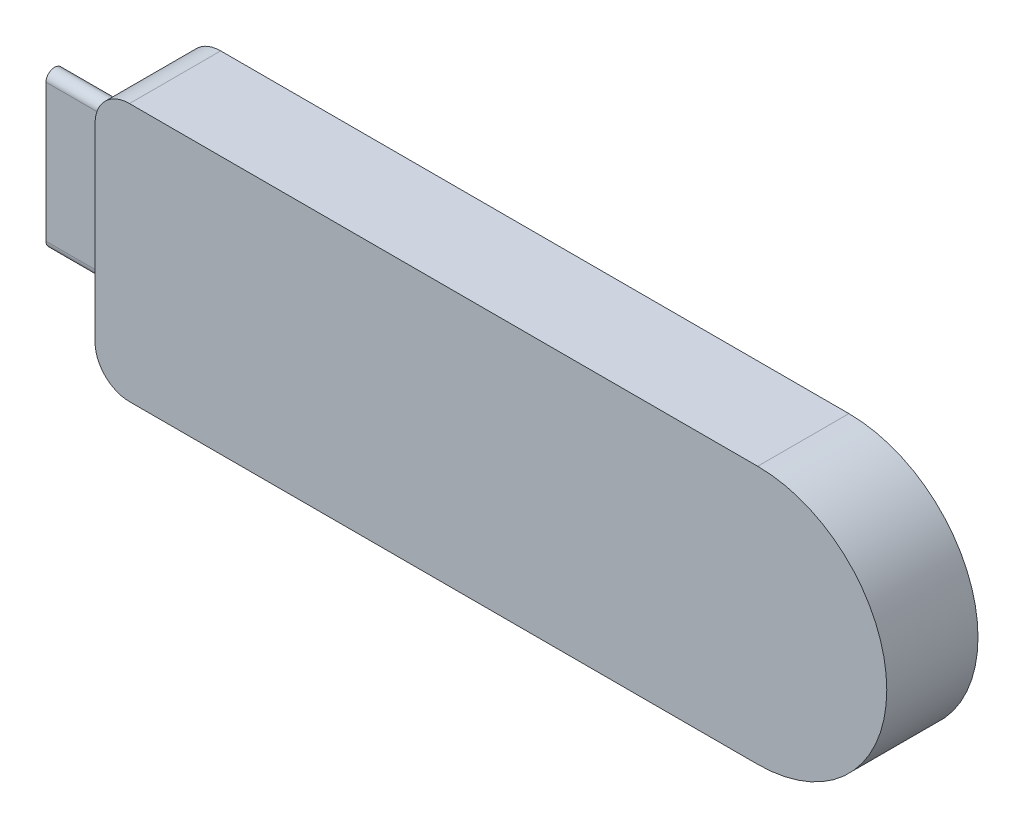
ISO-10303-21;
HEADER;
FILE_DESCRIPTION(('STEP AP214'),'2;1');
FILE_NAME('part.step','',(''),(''),'','','');
FILE_SCHEMA(('AUTOMOTIVE_DESIGN { 1 0 10303 214 1 1 1 1 }'));
ENDSEC;
DATA;
#1=APPLICATION_CONTEXT('core data for automotive mechanical design processes');
#2=APPLICATION_PROTOCOL_DEFINITION('international standard','automotive_design',2000,#1);
#3=PRODUCT_CONTEXT('',#1,'mechanical');
#4=PRODUCT('Part','Part','',(#3));
#5=PRODUCT_RELATED_PRODUCT_CATEGORY('part','',(#4));
#6=PRODUCT_DEFINITION_FORMATION('','',#4);
#7=PRODUCT_DEFINITION_CONTEXT('part definition',#1,'design');
#8=PRODUCT_DEFINITION('design','',#6,#7);
#9=PRODUCT_DEFINITION_SHAPE('','',#8);
#10=(LENGTH_UNIT() NAMED_UNIT(*) SI_UNIT(.MILLI.,.METRE.));
#11=(NAMED_UNIT(*) PLANE_ANGLE_UNIT() SI_UNIT($,.RADIAN.));
#12=(NAMED_UNIT(*) SI_UNIT($,.STERADIAN.) SOLID_ANGLE_UNIT());
#13=UNCERTAINTY_MEASURE_WITH_UNIT(LENGTH_MEASURE(1.E-05),#10,'distance_accuracy_value','');
#14=(GEOMETRIC_REPRESENTATION_CONTEXT(3) GLOBAL_UNCERTAINTY_ASSIGNED_CONTEXT((#13)) GLOBAL_UNIT_ASSIGNED_CONTEXT((#10,
#11,#12)) REPRESENTATION_CONTEXT('',''));
#15=CARTESIAN_POINT('',(0.,0.,0.));
#16=DIRECTION('',(0.,0.,1.));
#17=DIRECTION('',(1.,0.,0.));
#18=AXIS2_PLACEMENT_3D('',#15,#16,#17);
#19=CARTESIAN_POINT('',(-5.,-4.,2.65));
#20=DIRECTION('',(1.,0.,0.));
#21=DIRECTION('',(0.,0.,-1.));
#22=AXIS2_PLACEMENT_3D('',#19,#20,#21);
#23=CYLINDRICAL_SURFACE('',#22,0.5);
#24=CARTESIAN_POINT('',(0.,-4.,2.65));
#25=DIRECTION('',(-1.,0.,0.));
#26=DIRECTION('',(0.,0.,1.));
#27=AXIS2_PLACEMENT_3D('',#24,#25,#26);
#28=CIRCLE('',#27,0.5);
#29=CARTESIAN_POINT('',(0.,-4.,2.15));
#30=VERTEX_POINT('',#29);
#31=CARTESIAN_POINT('',(0.,-4.,3.15));
#32=VERTEX_POINT('',#31);
#33=EDGE_CURVE('E110',#30,#32,#28,.T.);
#34=ORIENTED_EDGE('',*,*,#33,.T.);
#35=DIRECTION('',(1.,0.,0.));
#36=VECTOR('',#35,1.);
#37=CARTESIAN_POINT('',(-5.,-4.,3.15));
#38=LINE('',#37,#36);
#39=CARTESIAN_POINT('',(-5.,-4.,3.15));
#40=VERTEX_POINT('',#39);
#41=EDGE_CURVE('E12',#40,#32,#38,.T.);
#42=ORIENTED_EDGE('',*,*,#41,.F.);
#43=CARTESIAN_POINT('',(-5.,-4.,2.65));
#44=DIRECTION('',(-1.,0.,0.));
#45=DIRECTION('',(0.,0.,1.));
#46=AXIS2_PLACEMENT_3D('',#43,#44,#45);
#47=CIRCLE('',#46,0.5);
#48=CARTESIAN_POINT('',(-5.,-4.,2.15));
#49=VERTEX_POINT('',#48);
#50=EDGE_CURVE('E98',#49,#40,#47,.T.);
#51=ORIENTED_EDGE('',*,*,#50,.F.);
#52=DIRECTION('',(1.,0.,0.));
#53=VECTOR('',#52,1.);
#54=CARTESIAN_POINT('',(-5.,-4.,2.15));
#55=LINE('',#54,#53);
#56=EDGE_CURVE('E106',#49,#30,#55,.T.);
#57=ORIENTED_EDGE('',*,*,#56,.T.);
#58=EDGE_LOOP('',(#34,#42,#51,#57));
#59=FACE_BOUND('',#58,.T.);
#60=ADVANCED_FACE('F47',(#59),#23,.T.);
#61=CARTESIAN_POINT('',(-5.,-4.,3.15));
#62=DIRECTION('',(0.,0.,-1.));
#63=DIRECTION('',(-1.,0.,0.));
#64=AXIS2_PLACEMENT_3D('',#61,#62,#63);
#65=PLANE('',#64);
#66=DIRECTION('',(0.,1.,0.));
#67=VECTOR('',#66,1.);
#68=CARTESIAN_POINT('',(0.,-4.,3.15));
#69=LINE('',#68,#67);
#70=CARTESIAN_POINT('',(0.,4.,3.15));
#71=VERTEX_POINT('',#70);
#72=EDGE_CURVE('E102',#32,#71,#69,.T.);
#73=ORIENTED_EDGE('',*,*,#72,.T.);
#74=DIRECTION('',(1.,0.,0.));
#75=VECTOR('',#74,1.);
#76=CARTESIAN_POINT('',(-5.,4.,3.15));
#77=LINE('',#76,#75);
#78=CARTESIAN_POINT('',(-5.,4.,3.15));
#79=VERTEX_POINT('',#78);
#80=EDGE_CURVE('E55',#79,#71,#77,.T.);
#81=ORIENTED_EDGE('',*,*,#80,.F.);
#82=DIRECTION('',(0.,1.,0.));
#83=VECTOR('',#82,1.);
#84=CARTESIAN_POINT('',(-5.,-4.,3.15));
#85=LINE('',#84,#83);
#86=EDGE_CURVE('E93',#40,#79,#85,.T.);
#87=ORIENTED_EDGE('',*,*,#86,.F.);
#88=ORIENTED_EDGE('',*,*,#41,.T.);
#89=EDGE_LOOP('',(#73,#81,#87,#88));
#90=FACE_BOUND('',#89,.T.);
#91=ADVANCED_FACE('F101',(#90),#65,.F.);
#92=CARTESIAN_POINT('',(-5.,4.,2.65));
#93=DIRECTION('',(1.,0.,0.));
#94=DIRECTION('',(0.,0.,-1.));
#95=AXIS2_PLACEMENT_3D('',#92,#93,#94);
#96=CYLINDRICAL_SURFACE('',#95,0.5);
#97=CARTESIAN_POINT('',(0.,4.,2.65));
#98=DIRECTION('',(-1.,0.,0.));
#99=DIRECTION('',(0.,0.,1.));
#100=AXIS2_PLACEMENT_3D('',#97,#98,#99);
#101=CIRCLE('',#100,0.5);
#102=CARTESIAN_POINT('',(0.,4.,2.15));
#103=VERTEX_POINT('',#102);
#104=EDGE_CURVE('E80',#71,#103,#101,.T.);
#105=ORIENTED_EDGE('',*,*,#104,.T.);
#106=DIRECTION('',(1.,0.,0.));
#107=VECTOR('',#106,1.);
#108=CARTESIAN_POINT('',(-5.,4.,2.15));
#109=LINE('',#108,#107);
#110=CARTESIAN_POINT('',(-5.,4.,2.15));
#111=VERTEX_POINT('',#110);
#112=EDGE_CURVE('E103',#111,#103,#109,.T.);
#113=ORIENTED_EDGE('',*,*,#112,.F.);
#114=CARTESIAN_POINT('',(-5.,4.,2.65));
#115=DIRECTION('',(-1.,0.,0.));
#116=DIRECTION('',(0.,0.,1.));
#117=AXIS2_PLACEMENT_3D('',#114,#115,#116);
#118=CIRCLE('',#117,0.5);
#119=EDGE_CURVE('E96',#79,#111,#118,.T.);
#120=ORIENTED_EDGE('',*,*,#119,.F.);
#121=ORIENTED_EDGE('',*,*,#80,.T.);
#122=EDGE_LOOP('',(#105,#113,#120,#121));
#123=FACE_BOUND('',#122,.T.);
#124=ADVANCED_FACE('F104',(#123),#96,.T.);
#125=CARTESIAN_POINT('',(-5.,-4.,2.15));
#126=DIRECTION('',(0.,0.,1.));
#127=DIRECTION('',(1.,0.,0.));
#128=AXIS2_PLACEMENT_3D('',#125,#126,#127);
#129=PLANE('',#128);
#130=DIRECTION('',(0.,-1.,0.));
#131=VECTOR('',#130,1.);
#132=CARTESIAN_POINT('',(0.,-4.,2.15));
#133=LINE('',#132,#131);
#134=EDGE_CURVE('E86',#103,#30,#133,.T.);
#135=ORIENTED_EDGE('',*,*,#134,.T.);
#136=ORIENTED_EDGE('',*,*,#56,.F.);
#137=DIRECTION('',(0.,-1.,0.));
#138=VECTOR('',#137,1.);
#139=CARTESIAN_POINT('',(-5.,-4.,2.15));
#140=LINE('',#139,#138);
#141=EDGE_CURVE('E63',#111,#49,#140,.T.);
#142=ORIENTED_EDGE('',*,*,#141,.F.);
#143=ORIENTED_EDGE('',*,*,#112,.T.);
#144=EDGE_LOOP('',(#135,#136,#142,#143));
#145=FACE_BOUND('',#144,.T.);
#146=ADVANCED_FACE('F117',(#145),#129,.F.);
#147=CARTESIAN_POINT('',(-5.,-4.,2.65));
#148=DIRECTION('',(-1.,0.,0.));
#149=DIRECTION('',(0.,0.,1.));
#150=AXIS2_PLACEMENT_3D('',#147,#148,#149);
#151=PLANE('',#150);
#152=ORIENTED_EDGE('',*,*,#50,.T.);
#153=ORIENTED_EDGE('',*,*,#86,.T.);
#154=ORIENTED_EDGE('',*,*,#119,.T.);
#155=ORIENTED_EDGE('',*,*,#141,.T.);
#156=EDGE_LOOP('',(#152,#153,#154,#155));
#157=FACE_BOUND('',#156,.T.);
#158=ADVANCED_FACE('F94',(#157),#151,.T.);
#159=CARTESIAN_POINT('',(0.,-4.,2.65));
#160=DIRECTION('',(-1.,0.,0.));
#161=DIRECTION('',(0.,0.,1.));
#162=AXIS2_PLACEMENT_3D('',#159,#160,#161);
#163=PLANE('',#162);
#164=ORIENTED_EDGE('',*,*,#33,.F.);
#165=ORIENTED_EDGE('',*,*,#134,.F.);
#166=ORIENTED_EDGE('',*,*,#104,.F.);
#167=ORIENTED_EDGE('',*,*,#72,.F.);
#168=EDGE_LOOP('',(#164,#165,#166,#167));
#169=FACE_BOUND('',#168,.T.);
#170=ADVANCED_FACE('F120',(#169),#163,.F.);
#171=CLOSED_SHELL('',(#60,#91,#124,#146,#158,#170));
#172=MANIFOLD_SOLID_BREP('B2',#171);
#173=CARTESIAN_POINT('',(28.,0.,0.));
#174=DIRECTION('',(0.,0.,-1.));
#175=DIRECTION('',(-1.,0.,0.));
#176=AXIS2_PLACEMENT_3D('',#173,#174,#175);
#177=PLANE('',#176);
#178=CARTESIAN_POINT('',(28.,0.,0.));
#179=DIRECTION('',(0.,0.,1.));
#180=DIRECTION('',(1.,0.,0.));
#181=AXIS2_PLACEMENT_3D('',#178,#179,#180);
#182=CIRCLE('',#181,1.5);
#183=CARTESIAN_POINT('',(29.5,0.,0.));
#184=VERTEX_POINT('',#183);
#185=EDGE_CURVE('E46',#184,#184,#182,.T.);
#186=ORIENTED_EDGE('',*,*,#185,.T.);
#187=EDGE_LOOP('',(#186));
#188=FACE_BOUND('',#187,.T.);
#189=ADVANCED_FACE('F179',(#188),#177,.F.);
#190=CARTESIAN_POINT('',(28.,0.,0.));
#191=DIRECTION('',(0.,0.,1.));
#192=DIRECTION('',(1.,0.,0.));
#193=AXIS2_PLACEMENT_3D('',#190,#191,#192);
#194=CYLINDRICAL_SURFACE('',#193,1.5);
#195=ORIENTED_EDGE('',*,*,#185,.F.);
#196=EDGE_LOOP('',(#195));
#197=FACE_BOUND('',#196,.T.);
#198=CARTESIAN_POINT('',(28.,0.,-2.3));
#199=DIRECTION('',(0.,0.,1.));
#200=DIRECTION('',(1.,0.,0.));
#201=AXIS2_PLACEMENT_3D('',#198,#199,#200);
#202=CIRCLE('',#201,1.5);
#203=CARTESIAN_POINT('',(29.5,0.,-2.3));
#204=VERTEX_POINT('',#203);
#205=EDGE_CURVE('E185',#204,#204,#202,.T.);
#206=ORIENTED_EDGE('',*,*,#205,.T.);
#207=EDGE_LOOP('',(#206));
#208=FACE_BOUND('',#207,.T.);
#209=ADVANCED_FACE('F191',(#197,#208),#194,.T.);
#210=CARTESIAN_POINT('',(28.,0.,-2.3));
#211=DIRECTION('',(0.,0.,1.));
#212=DIRECTION('',(-1.,0.,0.));
#213=AXIS2_PLACEMENT_3D('',#210,#211,#212);
#214=SPHERICAL_SURFACE('',#213,1.5);
#215=ORIENTED_EDGE('',*,*,#205,.F.);
#216=EDGE_LOOP('',(#215));
#217=FACE_BOUND('',#216,.T.);
#218=ADVANCED_FACE('F193',(#217),#214,.T.);
#219=CLOSED_SHELL('',(#189,#209,#218));
#220=MANIFOLD_SOLID_BREP('B6',#219);
#221=CARTESIAN_POINT('',(38.5,0.,0.));
#222=DIRECTION('',(0.,0.,-1.));
#223=DIRECTION('',(-1.,0.,0.));
#224=AXIS2_PLACEMENT_3D('',#221,#222,#223);
#225=PLANE('',#224);
#226=DIRECTION('',(0.,1.,0.));
#227=VECTOR('',#226,1.);
#228=CARTESIAN_POINT('',(43.5,0.,0.));
#229=LINE('',#228,#227);
#230=CARTESIAN_POINT('',(43.5,-3.,0.));
#231=VERTEX_POINT('',#230);
#232=CARTESIAN_POINT('',(43.5,3.,0.));
#233=VERTEX_POINT('',#232);
#234=EDGE_CURVE('E771',#231,#233,#229,.T.);
#235=ORIENTED_EDGE('',*,*,#234,.F.);
#236=DIRECTION('',(1.,0.,0.));
#237=VECTOR('',#236,1.);
#238=CARTESIAN_POINT('',(38.5,-3.,0.));
#239=LINE('',#238,#237);
#240=CARTESIAN_POINT('',(33.5,-3.,0.));
#241=VERTEX_POINT('',#240);
#242=EDGE_CURVE('E775',#241,#231,#239,.T.);
#243=ORIENTED_EDGE('',*,*,#242,.F.);
#244=DIRECTION('',(0.,-1.,0.));
#245=VECTOR('',#244,1.);
#246=CARTESIAN_POINT('',(33.5,0.,0.));
#247=LINE('',#246,#245);
#248=CARTESIAN_POINT('',(33.5,3.,0.));
#249=VERTEX_POINT('',#248);
#250=EDGE_CURVE('E779',#249,#241,#247,.T.);
#251=ORIENTED_EDGE('',*,*,#250,.F.);
#252=DIRECTION('',(-1.,0.,0.));
#253=VECTOR('',#252,1.);
#254=CARTESIAN_POINT('',(38.5,3.,0.));
#255=LINE('',#254,#253);
#256=EDGE_CURVE('E770',#233,#249,#255,.T.);
#257=ORIENTED_EDGE('',*,*,#256,.F.);
#258=EDGE_LOOP('',(#235,#243,#251,#257));
#259=FACE_BOUND('',#258,.T.);
#260=DIRECTION('',(1.,0.,0.));
#261=VECTOR('',#260,1.);
#262=CARTESIAN_POINT('',(38.5,-2.5,0.));
#263=LINE('',#262,#261);
#264=CARTESIAN_POINT('',(34.,-2.5,0.));
#265=VERTEX_POINT('',#264);
#266=CARTESIAN_POINT('',(43.,-2.5,0.));
#267=VERTEX_POINT('',#266);
#268=EDGE_CURVE('E229',#265,#267,#263,.T.);
#269=ORIENTED_EDGE('',*,*,#268,.T.);
#270=DIRECTION('',(0.,1.,0.));
#271=VECTOR('',#270,1.);
#272=CARTESIAN_POINT('',(43.,0.,0.));
#273=LINE('',#272,#271);
#274=CARTESIAN_POINT('',(43.,2.5,0.));
#275=VERTEX_POINT('',#274);
#276=EDGE_CURVE('E177',#267,#275,#273,.T.);
#277=ORIENTED_EDGE('',*,*,#276,.T.);
#278=DIRECTION('',(-1.,0.,0.));
#279=VECTOR('',#278,1.);
#280=CARTESIAN_POINT('',(38.5,2.5,0.));
#281=LINE('',#280,#279);
#282=CARTESIAN_POINT('',(34.,2.5,0.));
#283=VERTEX_POINT('',#282);
#284=EDGE_CURVE('E223',#275,#283,#281,.T.);
#285=ORIENTED_EDGE('',*,*,#284,.T.);
#286=DIRECTION('',(0.,-1.,0.));
#287=VECTOR('',#286,1.);
#288=CARTESIAN_POINT('',(34.,0.,0.));
#289=LINE('',#288,#287);
#290=EDGE_CURVE('E816',#283,#265,#289,.T.);
#291=ORIENTED_EDGE('',*,*,#290,.T.);
#292=EDGE_LOOP('',(#269,#277,#285,#291));
#293=FACE_BOUND('',#292,.T.);
#294=ADVANCED_FACE('F219',(#259,#293),#225,.T.);
#295=DIRECTION('',(1.,0.,0.));
#296=VECTOR('',#295,1.);
#297=CARTESIAN_POINT('',(0.,-7.5,0.));
#298=LINE('',#297,#296);
#299=CARTESIAN_POINT('',(2.,-7.5,0.));
#300=VERTEX_POINT('',#299);
#301=CARTESIAN_POINT('',(38.5,-7.5,0.));
#302=VERTEX_POINT('',#301);
#303=EDGE_CURVE('E474',#300,#302,#298,.T.);
#304=ORIENTED_EDGE('',*,*,#303,.F.);
#305=CARTESIAN_POINT('',(2.,-5.5,0.));
#306=DIRECTION('',(0.,0.,-1.));
#307=DIRECTION('',(-1.,0.,0.));
#308=AXIS2_PLACEMENT_3D('',#305,#306,#307);
#309=CIRCLE('',#308,2.);
#310=CARTESIAN_POINT('',(0.,-5.5,0.));
#311=VERTEX_POINT('',#310);
#312=EDGE_CURVE('E501',#300,#311,#309,.T.);
#313=ORIENTED_EDGE('',*,*,#312,.T.);
#314=DIRECTION('',(0.,-1.,0.));
#315=VECTOR('',#314,1.);
#316=CARTESIAN_POINT('',(0.,7.5,0.));
#317=LINE('',#316,#315);
#318=CARTESIAN_POINT('',(0.,5.5,0.));
#319=VERTEX_POINT('',#318);
#320=EDGE_CURVE('E488',#319,#311,#317,.T.);
#321=ORIENTED_EDGE('',*,*,#320,.F.);
#322=CARTESIAN_POINT('',(2.,5.5,0.));
#323=DIRECTION('',(0.,0.,-1.));
#324=DIRECTION('',(-1.,0.,0.));
#325=AXIS2_PLACEMENT_3D('',#322,#323,#324);
#326=CIRCLE('',#325,2.);
#327=CARTESIAN_POINT('',(2.,7.5,0.));
#328=VERTEX_POINT('',#327);
#329=EDGE_CURVE('E499',#319,#328,#326,.T.);
#330=ORIENTED_EDGE('',*,*,#329,.T.);
#331=DIRECTION('',(-1.,0.,0.));
#332=VECTOR('',#331,1.);
#333=CARTESIAN_POINT('',(0.,7.5,0.));
#334=LINE('',#333,#332);
#335=CARTESIAN_POINT('',(38.5,7.5,0.));
#336=VERTEX_POINT('',#335);
#337=EDGE_CURVE('E494',#336,#328,#334,.T.);
#338=ORIENTED_EDGE('',*,*,#337,.F.);
#339=CARTESIAN_POINT('',(38.5,0.,0.));
#340=DIRECTION('',(0.,0.,1.));
#341=DIRECTION('',(-1.,0.,0.));
#342=AXIS2_PLACEMENT_3D('',#339,#340,#341);
#343=CIRCLE('',#342,7.5);
#344=EDGE_CURVE('E492',#302,#336,#343,.T.);
#345=ORIENTED_EDGE('',*,*,#344,.F.);
#346=EDGE_LOOP('',(#304,#313,#321,#330,#338,#345));
#347=FACE_BOUND('',#346,.T.);
#348=ORIENTED_EDGE('',*,*,#242,.T.);
#349=ORIENTED_EDGE('',*,*,#234,.T.);
#350=ORIENTED_EDGE('',*,*,#256,.T.);
#351=ORIENTED_EDGE('',*,*,#250,.T.);
#352=EDGE_LOOP('',(#348,#349,#350,#351));
#353=FACE_BOUND('',#352,.T.);
#354=DIRECTION('',(1.,0.,0.));
#355=VECTOR('',#354,1.);
#356=CARTESIAN_POINT('',(38.5,-3.,0.));
#357=LINE('',#356,#355);
#358=CARTESIAN_POINT('',(12.5,-3.,0.));
#359=VERTEX_POINT('',#358);
#360=CARTESIAN_POINT('',(22.5,-3.,0.));
#361=VERTEX_POINT('',#360);
#362=EDGE_CURVE('E804',#359,#361,#357,.T.);
#363=ORIENTED_EDGE('',*,*,#362,.T.);
#364=DIRECTION('',(0.,1.,0.));
#365=VECTOR('',#364,1.);
#366=CARTESIAN_POINT('',(22.5,0.,0.));
#367=LINE('',#366,#365);
#368=CARTESIAN_POINT('',(22.5,3.,0.));
#369=VERTEX_POINT('',#368);
#370=EDGE_CURVE('E801',#361,#369,#367,.T.);
#371=ORIENTED_EDGE('',*,*,#370,.T.);
#372=DIRECTION('',(-1.,0.,0.));
#373=VECTOR('',#372,1.);
#374=CARTESIAN_POINT('',(38.5,3.,0.));
#375=LINE('',#374,#373);
#376=CARTESIAN_POINT('',(12.5,3.,0.));
#377=VERTEX_POINT('',#376);
#378=EDGE_CURVE('E789',#369,#377,#375,.T.);
#379=ORIENTED_EDGE('',*,*,#378,.T.);
#380=DIRECTION('',(0.,-1.,0.));
#381=VECTOR('',#380,1.);
#382=CARTESIAN_POINT('',(12.5,0.,0.));
#383=LINE('',#382,#381);
#384=EDGE_CURVE('E808',#377,#359,#383,.T.);
#385=ORIENTED_EDGE('',*,*,#384,.T.);
#386=EDGE_LOOP('',(#363,#371,#379,#385));
#387=FACE_BOUND('',#386,.T.);
#388=ADVANCED_FACE('F851',(#347,#353,#387),#225,.T.);
#389=ORIENTED_EDGE('',*,*,#370,.F.);
#390=ORIENTED_EDGE('',*,*,#362,.F.);
#391=ORIENTED_EDGE('',*,*,#384,.F.);
#392=ORIENTED_EDGE('',*,*,#378,.F.);
#393=EDGE_LOOP('',(#389,#390,#391,#392));
#394=FACE_BOUND('',#393,.T.);
#395=DIRECTION('',(1.,0.,0.));
#396=VECTOR('',#395,1.);
#397=CARTESIAN_POINT('',(38.5,-2.5,0.));
#398=LINE('',#397,#396);
#399=CARTESIAN_POINT('',(13.,-2.5,0.));
#400=VERTEX_POINT('',#399);
#401=CARTESIAN_POINT('',(22.,-2.5,0.));
#402=VERTEX_POINT('',#401);
#403=EDGE_CURVE('E790',#400,#402,#398,.T.);
#404=ORIENTED_EDGE('',*,*,#403,.T.);
#405=DIRECTION('',(0.,1.,0.));
#406=VECTOR('',#405,1.);
#407=CARTESIAN_POINT('',(22.,0.,0.));
#408=LINE('',#407,#406);
#409=CARTESIAN_POINT('',(22.,2.5,0.));
#410=VERTEX_POINT('',#409);
#411=EDGE_CURVE('E786',#402,#410,#408,.T.);
#412=ORIENTED_EDGE('',*,*,#411,.T.);
#413=DIRECTION('',(-1.,0.,0.));
#414=VECTOR('',#413,1.);
#415=CARTESIAN_POINT('',(38.5,2.5,0.));
#416=LINE('',#415,#414);
#417=CARTESIAN_POINT('',(13.,2.5,0.));
#418=VERTEX_POINT('',#417);
#419=EDGE_CURVE('E774',#410,#418,#416,.T.);
#420=ORIENTED_EDGE('',*,*,#419,.T.);
#421=DIRECTION('',(0.,-1.,0.));
#422=VECTOR('',#421,1.);
#423=CARTESIAN_POINT('',(13.,0.,0.));
#424=LINE('',#423,#422);
#425=EDGE_CURVE('E794',#418,#400,#424,.T.);
#426=ORIENTED_EDGE('',*,*,#425,.T.);
#427=EDGE_LOOP('',(#404,#412,#420,#426));
#428=FACE_BOUND('',#427,.T.);
#429=ADVANCED_FACE('F856',(#394,#428),#225,.T.);
#430=ORIENTED_EDGE('',*,*,#411,.F.);
#431=ORIENTED_EDGE('',*,*,#403,.F.);
#432=ORIENTED_EDGE('',*,*,#425,.F.);
#433=ORIENTED_EDGE('',*,*,#419,.F.);
#434=EDGE_LOOP('',(#430,#431,#432,#433));
#435=FACE_BOUND('',#434,.T.);
#436=CARTESIAN_POINT('',(20.0040665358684,-1.49063293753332,0.));
#437=CARTESIAN_POINT('',(20.0385461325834,-1.49012280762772,0.));
#438=CARTESIAN_POINT('',(20.1068415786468,-1.48911236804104,0.));
#439=CARTESIAN_POINT('',(20.2077840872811,-1.47902645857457,0.));
#440=CARTESIAN_POINT('',(20.3062153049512,-1.46364005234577,0.));
#441=CARTESIAN_POINT('',(20.4018490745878,-1.44142673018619,0.));
#442=CARTESIAN_POINT('',(20.494554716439,-1.41244788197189,0.));
#443=CARTESIAN_POINT('',(20.584441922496,-1.37737280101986,0.));
#444=CARTESIAN_POINT('',(20.6718268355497,-1.33667025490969,0.));
#445=CARTESIAN_POINT('',(20.7556251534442,-1.28917479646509,0.));
#446=CARTESIAN_POINT('',(20.8355516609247,-1.23636495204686,0.));
#447=CARTESIAN_POINT('',(20.9108316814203,-1.17850323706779,0.));
#448=CARTESIAN_POINT('',(20.9814235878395,-1.11612289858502,0.));
#449=CARTESIAN_POINT('',(21.0461946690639,-1.04819286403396,0.));
#450=CARTESIAN_POINT('',(21.1072426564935,-0.977175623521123,0.));
#451=CARTESIAN_POINT('',(21.1621265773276,-0.900431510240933,0.));
#452=CARTESIAN_POINT('',(21.2126388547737,-0.819701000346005,0.));
#453=CARTESIAN_POINT('',(21.257284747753,-0.734205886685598,0.));
#454=CARTESIAN_POINT('',(21.2976156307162,-0.646486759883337,0.));
#455=CARTESIAN_POINT('',(21.3315952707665,-0.556515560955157,0.));
#456=CARTESIAN_POINT('',(21.3614567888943,-0.465618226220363,0.));
#457=CARTESIAN_POINT('',(21.3852384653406,-0.373234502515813,0.));
#458=CARTESIAN_POINT('',(21.4041895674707,-0.279577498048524,0.));
#459=CARTESIAN_POINT('',(21.4169328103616,-0.184803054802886,0.));
#460=CARTESIAN_POINT('',(21.4261360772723,-0.0887700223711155,0.));
#461=CARTESIAN_POINT('',(21.4268059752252,-0.0243091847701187,0.));
#462=CARTESIAN_POINT('',(21.4271434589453,0.00816513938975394,0.));
#463=B_SPLINE_CURVE_WITH_KNOTS('',3,(#436,#437,#438,#439,#440,#441,#442,#443,#444,#445,#446,
#447,#448,#449,#450,#451,#452,#453,#454,#455,#456,#457,#458,#459,#460,#461,#462),.UNSPECIFIED.,
.F.,.F.,(4,1,1,1,1,1,1,1,1,1,1,1,1,1,1,1,1,1,1,1,1,1,1,1,4),(0.,0.0446969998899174,
0.0885335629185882,0.131409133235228,0.173813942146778,0.215714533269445,0.257247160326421,
0.298847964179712,0.340604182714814,0.382029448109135,0.422969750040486,0.46363222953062,
0.504047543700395,0.544591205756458,0.584963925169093,0.626265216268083,0.667979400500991,
0.709942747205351,0.751381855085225,0.792618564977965,0.833948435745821,0.875008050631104,
0.916445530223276,0.957906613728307,1.),.UNSPECIFIED.);
#464=CARTESIAN_POINT('',(21.4271434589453,0.00816513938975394,0.));
#465=VERTEX_POINT('',#464);
#466=CARTESIAN_POINT('',(20.0040665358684,-1.49063293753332,0.));
#467=VERTEX_POINT('',#466);
#468=EDGE_CURVE('E646',#465,#467,#463,.F.);
#469=ORIENTED_EDGE('',*,*,#468,.F.);
#470=CARTESIAN_POINT('',(21.4271434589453,0.00816513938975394,0.));
#471=CARTESIAN_POINT('',(21.4261007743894,0.068312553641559,0.));
#472=CARTESIAN_POINT('',(21.4240691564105,0.185506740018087,0.));
#473=CARTESIAN_POINT('',(21.4050866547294,0.356156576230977,0.));
#474=CARTESIAN_POINT('',(21.374263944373,0.516715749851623,0.));
#475=CARTESIAN_POINT('',(21.3302001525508,0.667171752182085,0.));
#476=CARTESIAN_POINT('',(21.2743491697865,0.807760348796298,0.));
#477=CARTESIAN_POINT('',(21.2064516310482,0.938799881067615,0.));
#478=CARTESIAN_POINT('',(21.1244652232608,1.05880707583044,0.));
#479=CARTESIAN_POINT('',(21.0317177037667,1.16892432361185,0.));
#480=CARTESIAN_POINT('',(20.9281229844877,1.26627604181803,0.));
#481=CARTESIAN_POINT('',(20.8178240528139,1.35273831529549,0.));
#482=CARTESIAN_POINT('',(20.6994436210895,1.42485807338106,0.));
#483=CARTESIAN_POINT('',(20.5740754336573,1.48440521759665,0.));
#484=CARTESIAN_POINT('',(20.4411868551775,1.53012379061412,0.));
#485=CARTESIAN_POINT('',(20.3011509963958,1.56213095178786,0.));
#486=CARTESIAN_POINT('',(20.1541176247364,1.58277868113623,0.));
#487=CARTESIAN_POINT('',(20.0536168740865,1.58510265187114,0.));
#488=CARTESIAN_POINT('',(20.002263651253,1.58629013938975,0.));
#489=B_SPLINE_CURVE_WITH_KNOTS('',3,(#470,#471,#472,#473,#474,#475,#476,#477,#478,#479,#480,
#481,#482,#483,#484,#485,#486,#487,#488),.UNSPECIFIED.,.F.,.F.,(4,1,1,1,1,1,1,1,1,1,1,1,1,1,1,1,
4),(0.,0.0752263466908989,0.146574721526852,0.214500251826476,0.279529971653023,
0.342402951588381,0.403496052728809,0.463761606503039,0.523864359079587,0.583251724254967,
0.641302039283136,0.698897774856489,0.756295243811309,0.814627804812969,0.874324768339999,
0.935783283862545,1.),.UNSPECIFIED.);
#490=CARTESIAN_POINT('',(20.002263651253,1.58629013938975,0.));
#491=VERTEX_POINT('',#490);
#492=EDGE_CURVE('E637',#491,#465,#489,.F.);
#493=ORIENTED_EDGE('',*,*,#492,.F.);
#494=CARTESIAN_POINT('',(20.002263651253,1.58629013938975,0.));
#495=CARTESIAN_POINT('',(19.9683926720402,1.58569868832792,0.));
#496=CARTESIAN_POINT('',(19.9011310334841,1.58452417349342,0.));
#497=CARTESIAN_POINT('',(19.8016907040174,1.57558768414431,0.));
#498=CARTESIAN_POINT('',(19.7048056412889,1.55963759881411,0.));
#499=CARTESIAN_POINT('',(19.6105712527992,1.53826269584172,0.));
#500=CARTESIAN_POINT('',(19.5187310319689,1.5102197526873,0.));
#501=CARTESIAN_POINT('',(19.4292301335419,1.47711591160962,0.));
#502=CARTESIAN_POINT('',(19.3428520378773,1.4360955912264,0.));
#503=CARTESIAN_POINT('',(19.2590220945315,1.39016926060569,0.));
#504=CARTESIAN_POINT('',(19.1787298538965,1.33879867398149,0.));
#505=CARTESIAN_POINT('',(19.1032714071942,1.28204969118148,0.));
#506=CARTESIAN_POINT('',(19.0328275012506,1.22035150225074,0.));
#507=CARTESIAN_POINT('',(18.9664518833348,1.15471825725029,0.));
#508=CARTESIAN_POINT('',(18.9063594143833,1.08293492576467,0.));
#509=CARTESIAN_POINT('',(18.8500675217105,1.00718815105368,0.));
#510=CARTESIAN_POINT('',(18.7991937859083,0.92613482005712,0.));
#511=CARTESIAN_POINT('',(18.7535576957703,0.840439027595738,0.));
#512=CARTESIAN_POINT('',(18.7127543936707,0.75142432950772,0.));
#513=CARTESIAN_POINT('',(18.6778800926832,0.658721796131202,0.));
#514=CARTESIAN_POINT('',(18.6479341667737,0.563443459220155,0.));
#515=CARTESIAN_POINT('',(18.6228669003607,0.465025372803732,0.));
#516=CARTESIAN_POINT('',(18.6048804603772,0.363501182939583,0.));
#517=CARTESIAN_POINT('',(18.5905576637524,0.259308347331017,0.));
#518=CARTESIAN_POINT('',(18.5830191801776,0.152106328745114,0.));
#519=CARTESIAN_POINT('',(18.5816718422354,0.0796894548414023,0.));
#520=CARTESIAN_POINT('',(18.5809896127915,0.0430209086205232,0.));
#521=B_SPLINE_CURVE_WITH_KNOTS('',3,(#494,#495,#496,#497,#498,#499,#500,#501,#502,#503,#504,
#505,#506,#507,#508,#509,#510,#511,#512,#513,#514,#515,#516,#517,#518,#519,#520),.UNSPECIFIED.,
.F.,.F.,(4,1,1,1,1,1,1,1,1,1,1,1,1,1,1,1,1,1,1,1,1,1,1,1,4),(0.,0.0430989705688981,
0.085586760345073,0.126907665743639,0.167967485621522,0.208449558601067,0.249025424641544,
0.289280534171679,0.330009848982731,0.370597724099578,0.4104659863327,0.450033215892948,
0.489688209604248,0.529116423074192,0.56903680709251,0.609703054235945,0.650758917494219,
0.692509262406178,0.734219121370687,0.776706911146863,0.819551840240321,0.863350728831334,
0.907838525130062,0.953333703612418,1.),.UNSPECIFIED.);
#522=CARTESIAN_POINT('',(18.5809896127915,0.0430209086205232,0.));
#523=VERTEX_POINT('',#522);
#524=EDGE_CURVE('E628',#523,#491,#521,.F.);
#525=ORIENTED_EDGE('',*,*,#524,.F.);
#526=CARTESIAN_POINT('',(18.5809896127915,0.0430209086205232,0.));
#527=CARTESIAN_POINT('',(18.581614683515,0.00574769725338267,0.));
#528=CARTESIAN_POINT('',(18.5828496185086,-0.0678919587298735,0.));
#529=CARTESIAN_POINT('',(18.5912056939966,-0.176680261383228,0.));
#530=CARTESIAN_POINT('',(18.6058985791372,-0.282345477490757,0.));
#531=CARTESIAN_POINT('',(18.6253861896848,-0.385202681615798,0.));
#532=CARTESIAN_POINT('',(18.6514989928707,-0.485037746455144,0.));
#533=CARTESIAN_POINT('',(18.6825300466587,-0.582136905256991,0.));
#534=CARTESIAN_POINT('',(18.7200638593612,-0.675921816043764,0.));
#535=CARTESIAN_POINT('',(18.7624541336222,-0.766618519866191,0.));
#536=CARTESIAN_POINT('',(18.8104187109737,-0.852979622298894,0.));
#537=CARTESIAN_POINT('',(18.8633268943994,-0.934401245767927,0.));
#538=CARTESIAN_POINT('',(18.9212161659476,-1.01012175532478,0.));
#539=CARTESIAN_POINT('',(18.9832071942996,-1.08107004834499,0.));
#540=CARTESIAN_POINT('',(19.0507476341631,-1.14597743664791,0.));
#541=CARTESIAN_POINT('',(19.1230058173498,-1.20545085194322,0.));
#542=CARTESIAN_POINT('',(19.1997039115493,-1.260051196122,0.));
#543=CARTESIAN_POINT('',(19.2810995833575,-1.30829972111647,0.));
#544=CARTESIAN_POINT('',(19.3657320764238,-1.35059127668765,0.));
#545=CARTESIAN_POINT('',(19.4519266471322,-1.38811150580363,0.));
#546=CARTESIAN_POINT('',(19.5397473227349,-1.42011025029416,0.));
#547=CARTESIAN_POINT('',(19.6294942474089,-1.44604205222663,0.));
#548=CARTESIAN_POINT('',(19.7209226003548,-1.46563798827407,0.));
#549=CARTESIAN_POINT('',(19.8137750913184,-1.48031163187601,0.));
#550=CARTESIAN_POINT('',(19.9083561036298,-1.48876076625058,0.));
#551=CARTESIAN_POINT('',(19.9719991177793,-1.49000567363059,0.));
#552=CARTESIAN_POINT('',(20.0040665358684,-1.49063293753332,0.));
#553=B_SPLINE_CURVE_WITH_KNOTS('',3,(#526,#527,#528,#529,#530,#531,#532,#533,#534,#535,#536,
#537,#538,#539,#540,#541,#542,#543,#544,#545,#546,#547,#548,#549,#550,#551,#552),.UNSPECIFIED.,
.F.,.F.,(4,1,1,1,1,1,1,1,1,1,1,1,1,1,1,1,1,1,1,1,1,1,1,1,4),(0.,0.0475595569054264,
0.0939621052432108,0.139111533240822,0.183626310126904,0.227457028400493,0.270702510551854,
0.313610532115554,0.356260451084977,0.398366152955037,0.439556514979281,0.48004538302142,
0.519888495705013,0.559657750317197,0.599421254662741,0.639207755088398,0.67966837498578,
0.720019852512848,0.759858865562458,0.799559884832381,0.839199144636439,0.878956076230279,
0.918794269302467,0.959083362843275,1.),.UNSPECIFIED.);
#554=EDGE_CURVE('E622',#467,#523,#553,.F.);
#555=ORIENTED_EDGE('',*,*,#554,.F.);
#556=EDGE_LOOP('',(#469,#493,#525,#555));
#557=FACE_BOUND('',#556,.T.);
#558=DIRECTION('',(-1.,0.,0.));
#559=VECTOR('',#558,1.);
#560=CARTESIAN_POINT('',(38.5,-1.45217139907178,0.));
#561=LINE('',#560,#559);
#562=CARTESIAN_POINT('',(18.0425280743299,-1.45217139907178,0.));
#563=VERTEX_POINT('',#562);
#564=CARTESIAN_POINT('',(17.619451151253,-1.45217139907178,0.));
#565=VERTEX_POINT('',#564);
#566=EDGE_CURVE('E728',#563,#565,#561,.T.);
#567=ORIENTED_EDGE('',*,*,#566,.F.);
#568=DIRECTION('',(0.,-1.,0.));
#569=VECTOR('',#568,1.);
#570=CARTESIAN_POINT('',(18.0425280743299,0.,0.));
#571=LINE('',#570,#569);
#572=CARTESIAN_POINT('',(18.0425280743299,1.54782860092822,0.));
#573=VERTEX_POINT('',#572);
#574=EDGE_CURVE('E724',#573,#563,#571,.T.);
#575=ORIENTED_EDGE('',*,*,#574,.F.);
#576=DIRECTION('',(1.,0.,0.));
#577=VECTOR('',#576,1.);
#578=CARTESIAN_POINT('',(38.5,1.54782860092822,0.));
#579=LINE('',#578,#577);
#580=CARTESIAN_POINT('',(16.0425280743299,1.54782860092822,0.));
#581=VERTEX_POINT('',#580);
#582=EDGE_CURVE('E720',#581,#573,#579,.T.);
#583=ORIENTED_EDGE('',*,*,#582,.F.);
#584=DIRECTION('',(0.,1.,0.));
#585=VECTOR('',#584,1.);
#586=CARTESIAN_POINT('',(16.0425280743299,0.,0.));
#587=LINE('',#586,#585);
#588=CARTESIAN_POINT('',(16.0425280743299,1.20167475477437,0.));
#589=VERTEX_POINT('',#588);
#590=EDGE_CURVE('E716',#589,#581,#587,.T.);
#591=ORIENTED_EDGE('',*,*,#590,.F.);
#592=DIRECTION('',(-1.,0.,0.));
#593=VECTOR('',#592,1.);
#594=CARTESIAN_POINT('',(38.5,1.20167475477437,0.));
#595=LINE('',#594,#593);
#596=CARTESIAN_POINT('',(17.619451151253,1.20167475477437,0.));
#597=VERTEX_POINT('',#596);
#598=EDGE_CURVE('E712',#597,#589,#595,.T.);
#599=ORIENTED_EDGE('',*,*,#598,.F.);
#600=DIRECTION('',(0.,1.,0.));
#601=VECTOR('',#600,1.);
#602=CARTESIAN_POINT('',(17.619451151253,0.,0.));
#603=LINE('',#602,#601);
#604=CARTESIAN_POINT('',(17.619451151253,0.240136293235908,0.));
#605=VERTEX_POINT('',#604);
#606=EDGE_CURVE('E708',#605,#597,#603,.T.);
#607=ORIENTED_EDGE('',*,*,#606,.F.);
#608=DIRECTION('',(1.,0.,0.));
#609=VECTOR('',#608,1.);
#610=CARTESIAN_POINT('',(38.5,0.240136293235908,0.));
#611=LINE('',#610,#609);
#612=CARTESIAN_POINT('',(16.2732973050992,0.240136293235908,0.));
#613=VERTEX_POINT('',#612);
#614=EDGE_CURVE('E704',#613,#605,#611,.T.);
#615=ORIENTED_EDGE('',*,*,#614,.F.);
#616=DIRECTION('',(0.,1.,0.));
#617=VECTOR('',#616,1.);
#618=CARTESIAN_POINT('',(16.2732973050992,0.,0.));
#619=LINE('',#618,#617);
#620=CARTESIAN_POINT('',(16.2732973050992,-0.106017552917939,0.));
#621=VERTEX_POINT('',#620);
#622=EDGE_CURVE('E700',#621,#613,#619,.T.);
#623=ORIENTED_EDGE('',*,*,#622,.F.);
#624=DIRECTION('',(-1.,0.,0.));
#625=VECTOR('',#624,1.);
#626=CARTESIAN_POINT('',(38.5,-0.106017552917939,0.));
#627=LINE('',#626,#625);
#628=CARTESIAN_POINT('',(17.619451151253,-0.106017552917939,0.));
#629=VERTEX_POINT('',#628);
#630=EDGE_CURVE('E696',#629,#621,#627,.T.);
#631=ORIENTED_EDGE('',*,*,#630,.F.);
#632=DIRECTION('',(0.,1.,0.));
#633=VECTOR('',#632,1.);
#634=CARTESIAN_POINT('',(17.619451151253,0.,0.));
#635=LINE('',#634,#633);
#636=EDGE_CURVE('E689',#565,#629,#635,.T.);
#637=ORIENTED_EDGE('',*,*,#636,.F.);
#638=EDGE_LOOP('',(#567,#575,#583,#591,#599,#607,#615,#623,#631,#637));
#639=FACE_BOUND('',#638,.T.);
#640=DIRECTION('',(-1.,0.,0.));
#641=VECTOR('',#640,1.);
#642=CARTESIAN_POINT('',(38.5,-1.45217139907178,0.));
#643=LINE('',#642,#641);
#644=CARTESIAN_POINT('',(15.5040665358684,-1.45217139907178,0.));
#645=VERTEX_POINT('',#644);
#646=CARTESIAN_POINT('',(15.0809896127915,-1.45217139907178,0.));
#647=VERTEX_POINT('',#646);
#648=EDGE_CURVE('E767',#645,#647,#643,.T.);
#649=ORIENTED_EDGE('',*,*,#648,.F.);
#650=DIRECTION('',(0.,-1.,0.));
#651=VECTOR('',#650,1.);
#652=CARTESIAN_POINT('',(15.5040665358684,0.,0.));
#653=LINE('',#652,#651);
#654=CARTESIAN_POINT('',(15.5040665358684,1.54782860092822,0.));
#655=VERTEX_POINT('',#654);
#656=EDGE_CURVE('E763',#655,#645,#653,.T.);
#657=ORIENTED_EDGE('',*,*,#656,.F.);
#658=DIRECTION('',(1.,0.,0.));
#659=VECTOR('',#658,1.);
#660=CARTESIAN_POINT('',(38.5,1.54782860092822,0.));
#661=LINE('',#660,#659);
#662=CARTESIAN_POINT('',(13.5040665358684,1.54782860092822,0.));
#663=VERTEX_POINT('',#662);
#664=EDGE_CURVE('E759',#663,#655,#661,.T.);
#665=ORIENTED_EDGE('',*,*,#664,.F.);
#666=DIRECTION('',(0.,1.,0.));
#667=VECTOR('',#666,1.);
#668=CARTESIAN_POINT('',(13.5040665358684,0.,0.));
#669=LINE('',#668,#667);
#670=CARTESIAN_POINT('',(13.5040665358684,1.20167475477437,0.));
#671=VERTEX_POINT('',#670);
#672=EDGE_CURVE('E755',#671,#663,#669,.T.);
#673=ORIENTED_EDGE('',*,*,#672,.F.);
#674=DIRECTION('',(-1.,0.,0.));
#675=VECTOR('',#674,1.);
#676=CARTESIAN_POINT('',(38.5,1.20167475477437,0.));
#677=LINE('',#676,#675);
#678=CARTESIAN_POINT('',(15.0809896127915,1.20167475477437,0.));
#679=VERTEX_POINT('',#678);
#680=EDGE_CURVE('E751',#679,#671,#677,.T.);
#681=ORIENTED_EDGE('',*,*,#680,.F.);
#682=DIRECTION('',(0.,1.,0.));
#683=VECTOR('',#682,1.);
#684=CARTESIAN_POINT('',(15.0809896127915,0.,0.));
#685=LINE('',#684,#683);
#686=CARTESIAN_POINT('',(15.0809896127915,0.240136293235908,0.));
#687=VERTEX_POINT('',#686);
#688=EDGE_CURVE('E747',#687,#679,#685,.T.);
#689=ORIENTED_EDGE('',*,*,#688,.F.);
#690=DIRECTION('',(1.,0.,0.));
#691=VECTOR('',#690,1.);
#692=CARTESIAN_POINT('',(38.5,0.240136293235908,0.));
#693=LINE('',#692,#691);
#694=CARTESIAN_POINT('',(13.7348357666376,0.240136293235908,0.));
#695=VERTEX_POINT('',#694);
#696=EDGE_CURVE('E743',#695,#687,#693,.T.);
#697=ORIENTED_EDGE('',*,*,#696,.F.);
#698=DIRECTION('',(0.,1.,0.));
#699=VECTOR('',#698,1.);
#700=CARTESIAN_POINT('',(13.7348357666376,0.,0.));
#701=LINE('',#700,#699);
#702=CARTESIAN_POINT('',(13.7348357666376,-0.106017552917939,0.));
#703=VERTEX_POINT('',#702);
#704=EDGE_CURVE('E739',#703,#695,#701,.T.);
#705=ORIENTED_EDGE('',*,*,#704,.F.);
#706=DIRECTION('',(-1.,0.,0.));
#707=VECTOR('',#706,1.);
#708=CARTESIAN_POINT('',(38.5,-0.106017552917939,0.));
#709=LINE('',#708,#707);
#710=CARTESIAN_POINT('',(15.0809896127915,-0.106017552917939,0.));
#711=VERTEX_POINT('',#710);
#712=EDGE_CURVE('E735',#711,#703,#709,.T.);
#713=ORIENTED_EDGE('',*,*,#712,.F.);
#714=DIRECTION('',(0.,1.,0.));
#715=VECTOR('',#714,1.);
#716=CARTESIAN_POINT('',(15.0809896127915,0.,0.));
#717=LINE('',#716,#715);
#718=EDGE_CURVE('E731',#647,#711,#717,.T.);
#719=ORIENTED_EDGE('',*,*,#718,.F.);
#720=EDGE_LOOP('',(#649,#657,#665,#673,#681,#689,#697,#705,#713,#719));
#721=FACE_BOUND('',#720,.T.);
#722=ADVANCED_FACE('F865',(#435,#557,#639,#721),#225,.T.);
#723=ORIENTED_EDGE('',*,*,#656,.T.);
#724=ORIENTED_EDGE('',*,*,#648,.T.);
#725=ORIENTED_EDGE('',*,*,#718,.T.);
#726=ORIENTED_EDGE('',*,*,#712,.T.);
#727=ORIENTED_EDGE('',*,*,#704,.T.);
#728=ORIENTED_EDGE('',*,*,#696,.T.);
#729=ORIENTED_EDGE('',*,*,#688,.T.);
#730=ORIENTED_EDGE('',*,*,#680,.T.);
#731=ORIENTED_EDGE('',*,*,#672,.T.);
#732=ORIENTED_EDGE('',*,*,#664,.T.);
#733=EDGE_LOOP('',(#723,#724,#725,#726,#727,#728,#729,#730,#731,#732));
#734=FACE_BOUND('',#733,.T.);
#735=ADVANCED_FACE('F870',(#734),#225,.T.);
#736=ORIENTED_EDGE('',*,*,#574,.T.);
#737=ORIENTED_EDGE('',*,*,#566,.T.);
#738=ORIENTED_EDGE('',*,*,#636,.T.);
#739=ORIENTED_EDGE('',*,*,#630,.T.);
#740=ORIENTED_EDGE('',*,*,#622,.T.);
#741=ORIENTED_EDGE('',*,*,#614,.T.);
#742=ORIENTED_EDGE('',*,*,#606,.T.);
#743=ORIENTED_EDGE('',*,*,#598,.T.);
#744=ORIENTED_EDGE('',*,*,#590,.T.);
#745=ORIENTED_EDGE('',*,*,#582,.T.);
#746=EDGE_LOOP('',(#736,#737,#738,#739,#740,#741,#742,#743,#744,#745));
#747=FACE_BOUND('',#746,.T.);
#748=ADVANCED_FACE('F878',(#747),#225,.T.);
#749=ORIENTED_EDGE('',*,*,#492,.T.);
#750=ORIENTED_EDGE('',*,*,#468,.T.);
#751=ORIENTED_EDGE('',*,*,#554,.T.);
#752=ORIENTED_EDGE('',*,*,#524,.T.);
#753=EDGE_LOOP('',(#749,#750,#751,#752));
#754=FACE_BOUND('',#753,.T.);
#755=CARTESIAN_POINT('',(21.0040665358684,0.00335744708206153,0.));
#756=CARTESIAN_POINT('',(21.0034181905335,-0.039954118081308,0.));
#757=CARTESIAN_POINT('',(21.0021539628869,-0.124408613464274,0.));
#758=CARTESIAN_POINT('',(20.9876905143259,-0.247538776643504,0.));
#759=CARTESIAN_POINT('',(20.9657445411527,-0.363718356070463,0.));
#760=CARTESIAN_POINT('',(20.9354943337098,-0.473273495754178,0.));
#761=CARTESIAN_POINT('',(20.8948306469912,-0.575120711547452,0.));
#762=CARTESIAN_POINT('',(20.8462119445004,-0.670238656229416,0.));
#763=CARTESIAN_POINT('',(20.7880012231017,-0.757995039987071,0.));
#764=CARTESIAN_POINT('',(20.7214827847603,-0.838144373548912,0.));
#765=CARTESIAN_POINT('',(20.6483201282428,-0.910144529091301,0.));
#766=CARTESIAN_POINT('',(20.5701384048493,-0.973032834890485,0.));
#767=CARTESIAN_POINT('',(20.486920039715,-1.02569734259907,0.));
#768=CARTESIAN_POINT('',(20.3995876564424,-1.06918313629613,0.));
#769=CARTESIAN_POINT('',(20.3075139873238,-1.10312776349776,0.));
#770=CARTESIAN_POINT('',(20.2109747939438,-1.12696282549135,0.));
#771=CARTESIAN_POINT('',(20.1098991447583,-1.14186972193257,0.));
#772=CARTESIAN_POINT('',(20.0409780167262,-1.1435984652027,0.));
#773=CARTESIAN_POINT('',(20.0058694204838,-1.14447909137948,0.));
#774=B_SPLINE_CURVE_WITH_KNOTS('',3,(#755,#756,#757,#758,#759,#760,#761,#762,#763,#764,#765,
#766,#767,#768,#769,#770,#771,#772,#773),.UNSPECIFIED.,.F.,.F.,(4,1,1,1,1,1,1,1,1,1,1,1,1,1,1,1,
4),(0.,0.0759644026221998,0.148125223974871,0.217200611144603,0.283299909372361,
0.347201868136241,0.409299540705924,0.470425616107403,0.531588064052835,0.59173917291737,
0.650257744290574,0.707303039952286,0.764208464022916,0.821147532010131,0.879118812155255,
0.938422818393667,1.),.UNSPECIFIED.);
#775=CARTESIAN_POINT('',(20.0058694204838,-1.14447909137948,0.));
#776=VERTEX_POINT('',#775);
#777=CARTESIAN_POINT('',(21.0040665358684,0.00335744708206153,0.));
#778=VERTEX_POINT('',#777);
#779=EDGE_CURVE('E672',#776,#778,#774,.F.);
#780=ORIENTED_EDGE('',*,*,#779,.T.);
#781=CARTESIAN_POINT('',(19.9998598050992,1.24013629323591,0.));
#782=CARTESIAN_POINT('',(20.0335675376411,1.2394668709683,0.));
#783=CARTESIAN_POINT('',(20.1000766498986,1.2381460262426,0.));
#784=CARTESIAN_POINT('',(20.1979859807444,1.22346278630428,0.));
#785=CARTESIAN_POINT('',(20.2923811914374,1.20152401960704,0.));
#786=CARTESIAN_POINT('',(20.3834087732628,1.17085245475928,0.));
#787=CARTESIAN_POINT('',(20.4702901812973,1.13023848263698,0.));
#788=CARTESIAN_POINT('',(20.5534755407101,1.08043100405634,0.));
#789=CARTESIAN_POINT('',(20.6337032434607,1.02278619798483,0.));
#790=CARTESIAN_POINT('',(20.7097082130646,0.95589956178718,0.));
#791=CARTESIAN_POINT('',(20.7805614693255,0.87906314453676,0.));
#792=CARTESIAN_POINT('',(20.8404607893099,0.788475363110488,0.));
#793=CARTESIAN_POINT('',(20.8909455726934,0.686298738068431,0.));
#794=CARTESIAN_POINT('',(20.9330994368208,0.572792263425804,0.));
#795=CARTESIAN_POINT('',(20.9652405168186,0.447076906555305,0.));
#796=CARTESIAN_POINT('',(20.987454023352,0.309693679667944,0.));
#797=CARTESIAN_POINT('',(21.0014791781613,0.160497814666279,0.));
#798=CARTESIAN_POINT('',(21.0031820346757,0.0570766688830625,0.));
#799=CARTESIAN_POINT('',(21.0040665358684,0.00335744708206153,0.));
#800=B_SPLINE_CURVE_WITH_KNOTS('',3,(#781,#782,#783,#784,#785,#786,#787,#788,#789,#790,#791,
#792,#793,#794,#795,#796,#797,#798,#799),.UNSPECIFIED.,.F.,.F.,(4,1,1,1,1,1,1,1,1,1,1,1,1,1,1,1,
4),(0.,0.0559431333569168,0.110382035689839,0.164047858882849,0.216759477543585,
0.269601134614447,0.323008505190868,0.377581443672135,0.433449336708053,0.490921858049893,
0.550624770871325,0.613116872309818,0.67986074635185,0.7513577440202,0.828261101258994,
0.910795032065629,1.),.UNSPECIFIED.);
#801=CARTESIAN_POINT('',(19.9998598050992,1.24013629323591,0.));
#802=VERTEX_POINT('',#801);
#803=EDGE_CURVE('E681',#778,#802,#800,.F.);
#804=ORIENTED_EDGE('',*,*,#803,.T.);
#805=CARTESIAN_POINT('',(19.0040665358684,0.0460257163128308,0.));
#806=CARTESIAN_POINT('',(19.0043219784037,0.0756868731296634,0.));
#807=CARTESIAN_POINT('',(19.0048230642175,0.133871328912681,0.));
#808=CARTESIAN_POINT('',(19.0114591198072,0.219635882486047,0.));
#809=CARTESIAN_POINT('',(19.0200187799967,0.302732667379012,0.));
#810=CARTESIAN_POINT('',(19.0330509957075,0.383054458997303,0.));
#811=CARTESIAN_POINT('',(19.0510110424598,0.46026862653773,0.));
#812=CARTESIAN_POINT('',(19.0709077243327,0.534963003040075,0.));
#813=CARTESIAN_POINT('',(19.095787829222,0.606493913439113,0.));
#814=CARTESIAN_POINT('',(19.1240177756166,0.67514187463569,0.));
#815=CARTESIAN_POINT('',(19.1556066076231,0.74055446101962,0.));
#816=CARTESIAN_POINT('',(19.1912346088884,0.802180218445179,0.));
#817=CARTESIAN_POINT('',(19.2304877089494,0.859779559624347,0.));
#818=CARTESIAN_POINT('',(19.2723068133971,0.914444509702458,0.));
#819=CARTESIAN_POINT('',(19.3190076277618,0.964059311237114,0.));
#820=CARTESIAN_POINT('',(19.3683414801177,1.01071971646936,0.));
#821=CARTESIAN_POINT('',(19.4214289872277,1.05346171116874,0.));
#822=CARTESIAN_POINT('',(19.4777403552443,1.09229646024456,0.));
#823=CARTESIAN_POINT('',(19.5364767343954,1.12725385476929,0.));
#824=CARTESIAN_POINT('',(19.5975170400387,1.15717284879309,0.));
#825=CARTESIAN_POINT('',(19.659888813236,1.18345292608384,0.));
#826=CARTESIAN_POINT('',(19.7246360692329,1.20359770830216,0.));
#827=CARTESIAN_POINT('',(19.790864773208,1.21984477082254,0.));
#828=CARTESIAN_POINT('',(19.8588426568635,1.23218592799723,0.));
#829=CARTESIAN_POINT('',(19.928822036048,1.23857675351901,0.));
#830=CARTESIAN_POINT('',(19.9760105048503,1.23961271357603,0.));
#831=CARTESIAN_POINT('',(19.9998598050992,1.24013629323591,0.));
#832=B_SPLINE_CURVE_WITH_KNOTS('',3,(#805,#806,#807,#808,#809,#810,#811,#812,#813,#814,#815,
#816,#817,#818,#819,#820,#821,#822,#823,#824,#825,#826,#827,#828,#829,#830,#831),.UNSPECIFIED.,
.F.,.F.,(4,1,1,1,1,1,1,1,1,1,1,1,1,1,1,1,1,1,1,1,1,1,1,1,4),(0.,0.0508516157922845,
0.0997524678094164,0.147437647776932,0.194085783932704,0.239170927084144,0.283339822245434,
0.326577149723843,0.368936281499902,0.410571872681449,0.451050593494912,0.490876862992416,
0.530044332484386,0.568936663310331,0.607577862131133,0.646420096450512,0.685679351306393,
0.724798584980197,0.76351300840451,0.802172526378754,0.840740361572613,0.879649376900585,
0.91907061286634,0.959097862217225,1.),.UNSPECIFIED.);
#833=CARTESIAN_POINT('',(19.0040665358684,0.0460257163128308,0.));
#834=VERTEX_POINT('',#833);
#835=EDGE_CURVE('E654',#802,#834,#832,.F.);
#836=ORIENTED_EDGE('',*,*,#835,.T.);
#837=CARTESIAN_POINT('',(20.0058694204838,-1.14447909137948,0.));
#838=CARTESIAN_POINT('',(19.9701657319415,-1.14358544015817,0.));
#839=CARTESIAN_POINT('',(19.9002580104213,-1.14183567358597,0.));
#840=CARTESIAN_POINT('',(19.7976585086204,-1.12718900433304,0.));
#841=CARTESIAN_POINT('',(19.7001774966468,-1.10225367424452,0.));
#842=CARTESIAN_POINT('',(19.6068487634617,-1.06905910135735,0.));
#843=CARTESIAN_POINT('',(19.5193596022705,-1.02418569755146,0.));
#844=CARTESIAN_POINT('',(19.4356638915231,-0.971639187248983,0.));
#845=CARTESIAN_POINT('',(19.3580431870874,-0.907428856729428,0.));
#846=CARTESIAN_POINT('',(19.2845921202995,-0.835301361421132,0.));
#847=CARTESIAN_POINT('',(19.2187114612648,-0.753315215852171,0.));
#848=CARTESIAN_POINT('',(19.1602562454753,-0.663490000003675,0.));
#849=CARTESIAN_POINT('',(19.1127713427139,-0.564478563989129,0.));
#850=CARTESIAN_POINT('',(19.0717745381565,-0.458461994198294,0.));
#851=CARTESIAN_POINT('',(19.0417543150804,-0.34343653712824,0.));
#852=CARTESIAN_POINT('',(19.0195675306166,-0.220709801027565,0.));
#853=CARTESIAN_POINT('',(19.0061973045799,-0.0898870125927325,0.));
#854=CARTESIAN_POINT('',(19.0047893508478,-7.95957367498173E-05,0.));
#855=CARTESIAN_POINT('',(19.0040665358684,0.0460257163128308,0.));
#856=B_SPLINE_CURVE_WITH_KNOTS('',3,(#837,#838,#839,#840,#841,#842,#843,#844,#845,#846,#847,
#848,#849,#850,#851,#852,#853,#854,#855),.UNSPECIFIED.,.F.,.F.,(4,1,1,1,1,1,1,1,1,1,1,1,1,1,1,1,
4),(0.,0.0610549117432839,0.119545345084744,0.176806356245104,0.232956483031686,
0.288583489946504,0.3446666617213,0.401661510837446,0.460540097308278,0.520477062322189,
0.581212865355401,0.64343075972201,0.707960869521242,0.775370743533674,0.84641367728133,
0.921151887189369,1.),.UNSPECIFIED.);
#857=EDGE_CURVE('E663',#834,#776,#856,.F.);
#858=ORIENTED_EDGE('',*,*,#857,.T.);
#859=EDGE_LOOP('',(#780,#804,#836,#858));
#860=FACE_BOUND('',#859,.T.);
#861=ADVANCED_FACE('F882',(#754,#860),#225,.T.);
#862=ORIENTED_EDGE('',*,*,#803,.F.);
#863=ORIENTED_EDGE('',*,*,#779,.F.);
#864=ORIENTED_EDGE('',*,*,#857,.F.);
#865=ORIENTED_EDGE('',*,*,#835,.F.);
#866=EDGE_LOOP('',(#862,#863,#864,#865));
#867=FACE_BOUND('',#866,.T.);
#868=ADVANCED_FACE('F887',(#867),#225,.T.);
#869=DIRECTION('',(0.,-1.,0.));
#870=VECTOR('',#869,1.);
#871=CARTESIAN_POINT('',(38.3689676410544,0.,0.));
#872=LINE('',#871,#870);
#873=CARTESIAN_POINT('',(38.3689676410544,1.63994237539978,0.));
#874=VERTEX_POINT('',#873);
#875=CARTESIAN_POINT('',(38.3689676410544,-1.36005762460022,0.));
#876=VERTEX_POINT('',#875);
#877=EDGE_CURVE('E615',#874,#876,#872,.T.);
#878=ORIENTED_EDGE('',*,*,#877,.T.);
#879=DIRECTION('',(-1.,0.,0.));
#880=VECTOR('',#879,1.);
#881=CARTESIAN_POINT('',(38.5,-1.36005762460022,0.));
#882=LINE('',#881,#880);
#883=CARTESIAN_POINT('',(37.9458907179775,-1.36005762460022,0.));
#884=VERTEX_POINT('',#883);
#885=EDGE_CURVE('E619',#876,#884,#882,.T.);
#886=ORIENTED_EDGE('',*,*,#885,.T.);
#887=DIRECTION('',(0.,1.,0.));
#888=VECTOR('',#887,1.);
#889=CARTESIAN_POINT('',(37.9458907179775,0.,0.));
#890=LINE('',#889,#888);
#891=CARTESIAN_POINT('',(37.9458907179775,0.878524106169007,0.));
#892=VERTEX_POINT('',#891);
#893=EDGE_CURVE('E580',#884,#892,#890,.T.);
#894=ORIENTED_EDGE('',*,*,#893,.T.);
#895=DIRECTION('',(-0.540335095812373,-0.84144992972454,0.));
#896=VECTOR('',#895,1.);
#897=CARTESIAN_POINT('',(37.7082354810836,0.508429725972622,0.));
#898=LINE('',#897,#896);
#899=CARTESIAN_POINT('',(36.5083907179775,-1.36005762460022,0.));
#900=VERTEX_POINT('',#899);
#901=EDGE_CURVE('E587',#892,#900,#898,.T.);
#902=ORIENTED_EDGE('',*,*,#901,.T.);
#903=DIRECTION('',(-1.,0.,0.));
#904=VECTOR('',#903,1.);
#905=CARTESIAN_POINT('',(38.5,-1.36005762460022,0.));
#906=LINE('',#905,#904);
#907=CARTESIAN_POINT('',(36.0612753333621,-1.36005762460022,0.));
#908=VERTEX_POINT('',#907);
#909=EDGE_CURVE('E591',#900,#908,#906,.T.);
#910=ORIENTED_EDGE('',*,*,#909,.T.);
#911=DIRECTION('',(0.,1.,0.));
#912=VECTOR('',#911,1.);
#913=CARTESIAN_POINT('',(36.0612753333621,0.,0.));
#914=LINE('',#913,#912);
#915=CARTESIAN_POINT('',(36.0612753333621,1.63994237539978,0.));
#916=VERTEX_POINT('',#915);
#917=EDGE_CURVE('E595',#908,#916,#914,.T.);
#918=ORIENTED_EDGE('',*,*,#917,.T.);
#919=DIRECTION('',(1.,0.,0.));
#920=VECTOR('',#919,1.);
#921=CARTESIAN_POINT('',(38.5,1.63994237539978,0.));
#922=LINE('',#921,#920);
#923=CARTESIAN_POINT('',(36.484352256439,1.63994237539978,0.));
#924=VERTEX_POINT('',#923);
#925=EDGE_CURVE('E599',#916,#924,#922,.T.);
#926=ORIENTED_EDGE('',*,*,#925,.T.);
#927=DIRECTION('',(0.,-1.,0.));
#928=VECTOR('',#927,1.);
#929=CARTESIAN_POINT('',(36.484352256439,0.,0.));
#930=LINE('',#929,#928);
#931=CARTESIAN_POINT('',(36.484352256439,-0.598639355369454,0.));
#932=VERTEX_POINT('',#931);
#933=EDGE_CURVE('E603',#924,#932,#930,.T.);
#934=ORIENTED_EDGE('',*,*,#933,.T.);
#935=DIRECTION('',(0.540335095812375,0.841449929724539,0.));
#936=VECTOR('',#935,1.);
#937=CARTESIAN_POINT('',(37.3450251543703,0.741664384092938,0.));
#938=LINE('',#937,#936);
#939=CARTESIAN_POINT('',(37.921852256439,1.63994237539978,0.));
#940=VERTEX_POINT('',#939);
#941=EDGE_CURVE('E607',#932,#940,#938,.T.);
#942=ORIENTED_EDGE('',*,*,#941,.T.);
#943=DIRECTION('',(1.,0.,0.));
#944=VECTOR('',#943,1.);
#945=CARTESIAN_POINT('',(38.5,1.63994237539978,0.));
#946=LINE('',#945,#944);
#947=EDGE_CURVE('E611',#940,#874,#946,.T.);
#948=ORIENTED_EDGE('',*,*,#947,.T.);
#949=EDGE_LOOP('',(#878,#886,#894,#902,#910,#918,#926,#934,#942,#948));
#950=FACE_BOUND('',#949,.T.);
#951=ADVANCED_FACE('F838',(#950),#225,.T.);
#952=CARTESIAN_POINT('',(41.7535830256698,0.100278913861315,0.));
#953=CARTESIAN_POINT('',(41.7525403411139,0.16042632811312,0.));
#954=CARTESIAN_POINT('',(41.750508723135,0.277620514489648,0.));
#955=CARTESIAN_POINT('',(41.7315262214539,0.448270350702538,0.));
#956=CARTESIAN_POINT('',(41.7007035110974,0.608829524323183,0.));
#957=CARTESIAN_POINT('',(41.6566397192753,0.759285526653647,0.));
#958=CARTESIAN_POINT('',(41.6007887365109,0.899874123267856,0.));
#959=CARTESIAN_POINT('',(41.5328911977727,1.03091365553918,0.));
#960=CARTESIAN_POINT('',(41.4509047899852,1.15092085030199,0.));
#961=CARTESIAN_POINT('',(41.3581572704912,1.26103809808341,0.));
#962=CARTESIAN_POINT('',(41.2545625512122,1.3583898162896,0.));
#963=CARTESIAN_POINT('',(41.1442636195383,1.44485208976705,0.));
#964=CARTESIAN_POINT('',(41.0258831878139,1.51697184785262,0.));
#965=CARTESIAN_POINT('',(40.9005150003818,1.57651899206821,0.));
#966=CARTESIAN_POINT('',(40.767626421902,1.62223756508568,0.));
#967=CARTESIAN_POINT('',(40.6275905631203,1.65424472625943,0.));
#968=CARTESIAN_POINT('',(40.4805571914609,1.67489245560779,0.));
#969=CARTESIAN_POINT('',(40.380056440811,1.6772164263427,0.));
#970=CARTESIAN_POINT('',(40.3287032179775,1.67840391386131,0.));
#971=B_SPLINE_CURVE_WITH_KNOTS('',3,(#952,#953,#954,#955,#956,#957,#958,#959,#960,#961,#962,
#963,#964,#965,#966,#967,#968,#969,#970),.UNSPECIFIED.,.F.,.F.,(4,1,1,1,1,1,1,1,1,1,1,1,1,1,1,1,
4),(0.,0.0752263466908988,0.146574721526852,0.214500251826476,0.279529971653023,
0.342402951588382,0.403496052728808,0.463761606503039,0.523864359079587,0.583251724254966,
0.641302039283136,0.698897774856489,0.756295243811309,0.814627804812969,0.874324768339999,
0.935783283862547,1.),.UNSPECIFIED.);
#972=CARTESIAN_POINT('',(40.3287032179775,1.67840391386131,0.));
#973=VERTEX_POINT('',#972);
#974=CARTESIAN_POINT('',(41.7535830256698,0.100278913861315,0.));
#975=VERTEX_POINT('',#974);
#976=EDGE_CURVE('E528',#973,#975,#971,.F.);
#977=ORIENTED_EDGE('',*,*,#976,.T.);
#978=CARTESIAN_POINT('',(40.3305061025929,-1.39851916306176,0.));
#979=CARTESIAN_POINT('',(40.3649856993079,-1.39800903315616,0.));
#980=CARTESIAN_POINT('',(40.4332811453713,-1.39699859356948,0.));
#981=CARTESIAN_POINT('',(40.5342236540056,-1.38691268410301,0.));
#982=CARTESIAN_POINT('',(40.6326548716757,-1.37152627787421,0.));
#983=CARTESIAN_POINT('',(40.7282886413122,-1.34931295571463,0.));
#984=CARTESIAN_POINT('',(40.8209942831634,-1.32033410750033,0.));
#985=CARTESIAN_POINT('',(40.9108814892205,-1.2852590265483,0.));
#986=CARTESIAN_POINT('',(40.9982664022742,-1.24455648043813,0.));
#987=CARTESIAN_POINT('',(41.0820647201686,-1.19706102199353,0.));
#988=CARTESIAN_POINT('',(41.1619912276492,-1.1442511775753,0.));
#989=CARTESIAN_POINT('',(41.2372712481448,-1.08638946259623,0.));
#990=CARTESIAN_POINT('',(41.307863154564,-1.02400912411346,0.));
#991=CARTESIAN_POINT('',(41.3726342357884,-0.956079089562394,0.));
#992=CARTESIAN_POINT('',(41.433682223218,-0.885061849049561,0.));
#993=CARTESIAN_POINT('',(41.4885661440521,-0.808317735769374,0.));
#994=CARTESIAN_POINT('',(41.5390784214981,-0.727587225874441,0.));
#995=CARTESIAN_POINT('',(41.5837243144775,-0.64209211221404,0.));
#996=CARTESIAN_POINT('',(41.6240551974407,-0.554372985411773,0.));
#997=CARTESIAN_POINT('',(41.658034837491,-0.464401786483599,0.));
#998=CARTESIAN_POINT('',(41.6878963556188,-0.3735044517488,0.));
#999=CARTESIAN_POINT('',(41.711678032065,-0.281120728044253,0.));
#1000=CARTESIAN_POINT('',(41.7306291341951,-0.187463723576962,0.));
#1001=CARTESIAN_POINT('',(41.7433723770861,-0.092689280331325,0.));
#1002=CARTESIAN_POINT('',(41.7525756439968,0.00334375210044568,0.));
#1003=CARTESIAN_POINT('',(41.7532455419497,0.0678045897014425,0.));
#1004=CARTESIAN_POINT('',(41.7535830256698,0.100278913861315,0.));
#1005=B_SPLINE_CURVE_WITH_KNOTS('',3,(#978,#979,#980,#981,#982,#983,#984,#985,#986,#987,#988,
#989,#990,#991,#992,#993,#994,#995,#996,#997,#998,#999,#1000,#1001,#1002,#1003,#1004),
.UNSPECIFIED.,.F.,.F.,(4,1,1,1,1,1,1,1,1,1,1,1,1,1,1,1,1,1,1,1,1,1,1,1,4),(0.,
0.0446969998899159,0.0885335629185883,0.131409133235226,0.173813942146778,0.215714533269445,
0.25724716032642,0.298847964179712,0.340604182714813,0.382029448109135,0.422969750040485,
0.463632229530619,0.504047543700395,0.544591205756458,0.584963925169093,0.626265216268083,
0.667979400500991,0.70994274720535,0.751381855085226,0.792618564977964,0.833948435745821,
0.875008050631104,0.916445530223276,0.957906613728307,1.),.UNSPECIFIED.);
#1006=CARTESIAN_POINT('',(40.3305061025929,-1.39851916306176,0.));
#1007=VERTEX_POINT('',#1006);
#1008=EDGE_CURVE('E537',#975,#1007,#1005,.F.);
#1009=ORIENTED_EDGE('',*,*,#1008,.T.);
#1010=CARTESIAN_POINT('',(38.907429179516,0.135134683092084,0.));
#1011=CARTESIAN_POINT('',(38.9080542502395,0.0978614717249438,0.));
#1012=CARTESIAN_POINT('',(38.9092891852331,0.0242218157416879,0.));
#1013=CARTESIAN_POINT('',(38.9176452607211,-0.0845664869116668,0.));
#1014=CARTESIAN_POINT('',(38.9323381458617,-0.190231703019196,0.));
#1015=CARTESIAN_POINT('',(38.9518257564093,-0.293088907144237,0.));
#1016=CARTESIAN_POINT('',(38.9779385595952,-0.392923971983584,0.));
#1017=CARTESIAN_POINT('',(39.0089696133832,-0.490023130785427,0.));
#1018=CARTESIAN_POINT('',(39.0465034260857,-0.583808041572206,0.));
#1019=CARTESIAN_POINT('',(39.0888937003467,-0.674504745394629,0.));
#1020=CARTESIAN_POINT('',(39.1368582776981,-0.760865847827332,0.));
#1021=CARTESIAN_POINT('',(39.1897664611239,-0.84228747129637,0.));
#1022=CARTESIAN_POINT('',(39.2476557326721,-0.918007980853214,0.));
#1023=CARTESIAN_POINT('',(39.3096467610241,-0.988956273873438,0.));
#1024=CARTESIAN_POINT('',(39.3771872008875,-1.05386366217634,0.));
#1025=CARTESIAN_POINT('',(39.4494453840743,-1.11333707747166,0.));
#1026=CARTESIAN_POINT('',(39.5261434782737,-1.16793742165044,0.));
#1027=CARTESIAN_POINT('',(39.607539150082,-1.21618594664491,0.));
#1028=CARTESIAN_POINT('',(39.6921716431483,-1.25847750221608,0.));
#1029=CARTESIAN_POINT('',(39.7783662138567,-1.29599773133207,0.));
#1030=CARTESIAN_POINT('',(39.8661868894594,-1.3279964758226,0.));
#1031=CARTESIAN_POINT('',(39.9559338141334,-1.35392827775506,0.));
#1032=CARTESIAN_POINT('',(40.0473621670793,-1.37352421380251,0.));
#1033=CARTESIAN_POINT('',(40.1402146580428,-1.38819785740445,0.));
#1034=CARTESIAN_POINT('',(40.2347956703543,-1.39664699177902,0.));
#1035=CARTESIAN_POINT('',(40.2984386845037,-1.39789189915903,0.));
#1036=CARTESIAN_POINT('',(40.3305061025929,-1.39851916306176,0.));
#1037=B_SPLINE_CURVE_WITH_KNOTS('',3,(#1010,#1011,#1012,#1013,#1014,#1015,#1016,#1017,#1018,
#1019,#1020,#1021,#1022,#1023,#1024,#1025,#1026,#1027,#1028,#1029,#1030,#1031,#1032,#1033,#1034,
#1035,#1036),.UNSPECIFIED.,.F.,.F.,(4,1,1,1,1,1,1,1,1,1,1,1,1,1,1,1,1,1,1,1,1,1,1,1,4),(0.,
0.0475595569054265,0.0939621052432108,0.139111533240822,0.183626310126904,0.227457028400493,
0.270702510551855,0.313610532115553,0.356260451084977,0.398366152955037,0.43955651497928,
0.480045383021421,0.519888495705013,0.559657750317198,0.59942125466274,0.639207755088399,
0.67966837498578,0.720019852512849,0.759858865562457,0.799559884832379,0.839199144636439,
0.878956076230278,0.918794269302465,0.959083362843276,1.),.UNSPECIFIED.);
#1038=CARTESIAN_POINT('',(38.907429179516,0.135134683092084,0.));
#1039=VERTEX_POINT('',#1038);
#1040=EDGE_CURVE('E513',#1007,#1039,#1037,.F.);
#1041=ORIENTED_EDGE('',*,*,#1040,.T.);
#1042=CARTESIAN_POINT('',(40.3287032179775,1.67840391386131,0.));
#1043=CARTESIAN_POINT('',(40.2948322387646,1.67781246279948,0.));
#1044=CARTESIAN_POINT('',(40.2275706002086,1.67663794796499,0.));
#1045=CARTESIAN_POINT('',(40.1281302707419,1.66770145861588,0.));
#1046=CARTESIAN_POINT('',(40.0312452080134,1.65175137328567,0.));
#1047=CARTESIAN_POINT('',(39.9370108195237,1.63037647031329,0.));
#1048=CARTESIAN_POINT('',(39.8451705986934,1.60233352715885,0.));
#1049=CARTESIAN_POINT('',(39.7556697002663,1.56922968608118,0.));
#1050=CARTESIAN_POINT('',(39.6692916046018,1.52820936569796,0.));
#1051=CARTESIAN_POINT('',(39.585461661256,1.48228303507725,0.));
#1052=CARTESIAN_POINT('',(39.505169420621,1.43091244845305,0.));
#1053=CARTESIAN_POINT('',(39.4297109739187,1.37416346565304,0.));
#1054=CARTESIAN_POINT('',(39.359267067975,1.3124652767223,0.));
#1055=CARTESIAN_POINT('',(39.2928914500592,1.24683203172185,0.));
#1056=CARTESIAN_POINT('',(39.2327989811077,1.17504870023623,0.));
#1057=CARTESIAN_POINT('',(39.176507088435,1.09930192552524,0.));
#1058=CARTESIAN_POINT('',(39.1256333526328,1.01824859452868,0.));
#1059=CARTESIAN_POINT('',(39.0799972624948,0.9325528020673,0.));
#1060=CARTESIAN_POINT('',(39.0391939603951,0.84353810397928,0.));
#1061=CARTESIAN_POINT('',(39.0043196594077,0.750835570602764,0.));
#1062=CARTESIAN_POINT('',(38.9743737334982,0.655557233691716,0.));
#1063=CARTESIAN_POINT('',(38.9493064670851,0.557139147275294,0.));
#1064=CARTESIAN_POINT('',(38.9313200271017,0.455614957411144,0.));
#1065=CARTESIAN_POINT('',(38.9169972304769,0.351422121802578,0.));
#1066=CARTESIAN_POINT('',(38.9094587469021,0.244220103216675,0.));
#1067=CARTESIAN_POINT('',(38.9081114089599,0.171803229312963,0.));
#1068=CARTESIAN_POINT('',(38.907429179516,0.135134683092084,0.));
#1069=B_SPLINE_CURVE_WITH_KNOTS('',3,(#1042,#1043,#1044,#1045,#1046,#1047,#1048,#1049,#1050,
#1051,#1052,#1053,#1054,#1055,#1056,#1057,#1058,#1059,#1060,#1061,#1062,#1063,#1064,#1065,#1066,
#1067,#1068),.UNSPECIFIED.,.F.,.F.,(4,1,1,1,1,1,1,1,1,1,1,1,1,1,1,1,1,1,1,1,1,1,1,1,4),(0.,
0.0430989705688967,0.085586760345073,0.126907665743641,0.167967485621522,0.208449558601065,
0.249025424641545,0.289280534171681,0.330009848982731,0.370597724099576,0.4104659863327,
0.450033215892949,0.489688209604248,0.529116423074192,0.56903680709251,0.609703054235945,
0.65075891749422,0.692509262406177,0.734219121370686,0.776706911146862,0.819551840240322,
0.863350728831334,0.907838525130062,0.953333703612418,1.),.UNSPECIFIED.);
#1070=EDGE_CURVE('E519',#1039,#973,#1069,.F.);
#1071=ORIENTED_EDGE('',*,*,#1070,.T.);
#1072=EDGE_LOOP('',(#977,#1009,#1041,#1071));
#1073=FACE_BOUND('',#1072,.T.);
#1074=CARTESIAN_POINT('',(41.3305061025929,0.0954712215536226,0.));
#1075=CARTESIAN_POINT('',(41.329857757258,0.0521596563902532,0.));
#1076=CARTESIAN_POINT('',(41.3285935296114,-0.0322948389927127,0.));
#1077=CARTESIAN_POINT('',(41.3141300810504,-0.155425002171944,0.));
#1078=CARTESIAN_POINT('',(41.2921841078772,-0.2716045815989,0.));
#1079=CARTESIAN_POINT('',(41.2619339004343,-0.381159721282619,0.));
#1080=CARTESIAN_POINT('',(41.2212702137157,-0.48300693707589,0.));
#1081=CARTESIAN_POINT('',(41.1726515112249,-0.578124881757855,0.));
#1082=CARTESIAN_POINT('',(41.1144407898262,-0.665881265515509,0.));
#1083=CARTESIAN_POINT('',(41.0479223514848,-0.746030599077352,0.));
#1084=CARTESIAN_POINT('',(40.9747596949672,-0.818030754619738,0.));
#1085=CARTESIAN_POINT('',(40.8965779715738,-0.880919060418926,0.));
#1086=CARTESIAN_POINT('',(40.8133596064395,-0.933583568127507,0.));
#1087=CARTESIAN_POINT('',(40.7260272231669,-0.977069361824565,0.));
#1088=CARTESIAN_POINT('',(40.6339535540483,-1.0110139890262,0.));
#1089=CARTESIAN_POINT('',(40.5374143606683,-1.03484905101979,0.));
#1090=CARTESIAN_POINT('',(40.4363387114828,-1.049755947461,0.));
#1091=CARTESIAN_POINT('',(40.3674175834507,-1.05148469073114,0.));
#1092=CARTESIAN_POINT('',(40.3323089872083,-1.05236531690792,0.));
#1093=B_SPLINE_CURVE_WITH_KNOTS('',3,(#1074,#1075,#1076,#1077,#1078,#1079,#1080,#1081,#1082,
#1083,#1084,#1085,#1086,#1087,#1088,#1089,#1090,#1091,#1092),.UNSPECIFIED.,.F.,.F.,(4,1,1,1,1,1,
1,1,1,1,1,1,1,1,1,1,4),(0.,0.0759644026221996,0.148125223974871,0.217200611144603,
0.28329990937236,0.347201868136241,0.409299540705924,0.470425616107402,0.531588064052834,
0.59173917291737,0.650257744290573,0.707303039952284,0.764208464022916,0.821147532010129,
0.879118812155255,0.938422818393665,1.),.UNSPECIFIED.);
#1094=CARTESIAN_POINT('',(40.3323089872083,-1.05236531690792,0.));
#1095=VERTEX_POINT('',#1094);
#1096=CARTESIAN_POINT('',(41.3305061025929,0.0954712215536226,0.));
#1097=VERTEX_POINT('',#1096);
#1098=EDGE_CURVE('E563',#1095,#1097,#1093,.F.);
#1099=ORIENTED_EDGE('',*,*,#1098,.T.);
#1100=CARTESIAN_POINT('',(40.3262993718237,1.33225006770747,0.));
#1101=CARTESIAN_POINT('',(40.3600071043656,1.33158064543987,0.));
#1102=CARTESIAN_POINT('',(40.4265162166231,1.33025980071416,0.));
#1103=CARTESIAN_POINT('',(40.5244255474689,1.31557656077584,0.));
#1104=CARTESIAN_POINT('',(40.6188207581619,1.2936377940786,0.));
#1105=CARTESIAN_POINT('',(40.7098483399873,1.26296622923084,0.));
#1106=CARTESIAN_POINT('',(40.7967297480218,1.22235225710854,0.));
#1107=CARTESIAN_POINT('',(40.8799151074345,1.1725447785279,0.));
#1108=CARTESIAN_POINT('',(40.9601428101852,1.11489997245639,0.));
#1109=CARTESIAN_POINT('',(41.0361477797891,1.04801333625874,0.));
#1110=CARTESIAN_POINT('',(41.10700103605,0.971176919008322,0.));
#1111=CARTESIAN_POINT('',(41.1669003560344,0.880589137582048,0.));
#1112=CARTESIAN_POINT('',(41.2173851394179,0.778412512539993,0.));
#1113=CARTESIAN_POINT('',(41.2595390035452,0.664906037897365,0.));
#1114=CARTESIAN_POINT('',(41.2916800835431,0.539190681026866,0.));
#1115=CARTESIAN_POINT('',(41.3138935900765,0.401807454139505,0.));
#1116=CARTESIAN_POINT('',(41.3279187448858,0.25261158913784,0.));
#1117=CARTESIAN_POINT('',(41.3296216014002,0.149190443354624,0.));
#1118=CARTESIAN_POINT('',(41.3305061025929,0.0954712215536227,0.));
#1119=B_SPLINE_CURVE_WITH_KNOTS('',3,(#1100,#1101,#1102,#1103,#1104,#1105,#1106,#1107,#1108,
#1109,#1110,#1111,#1112,#1113,#1114,#1115,#1116,#1117,#1118),.UNSPECIFIED.,.F.,.F.,(4,1,1,1,1,1,
1,1,1,1,1,1,1,1,1,1,4),(0.,0.0559431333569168,0.110382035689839,0.164047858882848,
0.216759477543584,0.269601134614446,0.323008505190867,0.377581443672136,0.433449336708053,
0.490921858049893,0.550624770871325,0.613116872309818,0.67986074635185,0.7513577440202,
0.828261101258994,0.910795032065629,1.),.UNSPECIFIED.);
#1120=CARTESIAN_POINT('',(40.3262993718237,1.33225006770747,0.));
#1121=VERTEX_POINT('',#1120);
#1122=EDGE_CURVE('E572',#1097,#1121,#1119,.F.);
#1123=ORIENTED_EDGE('',*,*,#1122,.T.);
#1124=CARTESIAN_POINT('',(39.3305061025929,0.138139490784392,0.));
#1125=CARTESIAN_POINT('',(39.3307615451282,0.167800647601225,0.));
#1126=CARTESIAN_POINT('',(39.331262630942,0.225985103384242,0.));
#1127=CARTESIAN_POINT('',(39.3378986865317,0.311749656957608,0.));
#1128=CARTESIAN_POINT('',(39.3464583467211,0.394846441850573,0.));
#1129=CARTESIAN_POINT('',(39.3594905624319,0.475168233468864,0.));
#1130=CARTESIAN_POINT('',(39.3774506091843,0.55238240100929,0.));
#1131=CARTESIAN_POINT('',(39.3973472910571,0.627076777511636,0.));
#1132=CARTESIAN_POINT('',(39.4222273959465,0.698607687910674,0.));
#1133=CARTESIAN_POINT('',(39.450457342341,0.767255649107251,0.));
#1134=CARTESIAN_POINT('',(39.4820461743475,0.832668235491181,0.));
#1135=CARTESIAN_POINT('',(39.5176741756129,0.894293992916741,0.));
#1136=CARTESIAN_POINT('',(39.5569272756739,0.951893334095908,0.));
#1137=CARTESIAN_POINT('',(39.5987463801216,1.00655828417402,0.));
#1138=CARTESIAN_POINT('',(39.6454471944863,1.05617308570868,0.));
#1139=CARTESIAN_POINT('',(39.6947810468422,1.10283349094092,0.));
#1140=CARTESIAN_POINT('',(39.7478685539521,1.1455754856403,0.));
#1141=CARTESIAN_POINT('',(39.8041799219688,1.18441023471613,0.));
#1142=CARTESIAN_POINT('',(39.8629163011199,1.21936762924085,0.));
#1143=CARTESIAN_POINT('',(39.9239566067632,1.24928662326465,0.));
#1144=CARTESIAN_POINT('',(39.9863283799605,1.2755667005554,0.));
#1145=CARTESIAN_POINT('',(40.0510756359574,1.29571148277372,0.));
#1146=CARTESIAN_POINT('',(40.1173043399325,1.3119585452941,0.));
#1147=CARTESIAN_POINT('',(40.185282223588,1.3242997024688,0.));
#1148=CARTESIAN_POINT('',(40.2552616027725,1.33069052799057,0.));
#1149=CARTESIAN_POINT('',(40.3024500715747,1.33172648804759,0.));
#1150=CARTESIAN_POINT('',(40.3262993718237,1.33225006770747,0.));
#1151=B_SPLINE_CURVE_WITH_KNOTS('',3,(#1124,#1125,#1126,#1127,#1128,#1129,#1130,#1131,#1132,
#1133,#1134,#1135,#1136,#1137,#1138,#1139,#1140,#1141,#1142,#1143,#1144,#1145,#1146,#1147,#1148,
#1149,#1150),.UNSPECIFIED.,.F.,.F.,(4,1,1,1,1,1,1,1,1,1,1,1,1,1,1,1,1,1,1,1,1,1,1,1,4),(0.,
0.0508516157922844,0.0997524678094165,0.147437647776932,0.194085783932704,0.239170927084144,
0.283339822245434,0.326577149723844,0.368936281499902,0.410571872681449,0.451050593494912,
0.490876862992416,0.530044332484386,0.568936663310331,0.607577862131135,0.646420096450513,
0.685679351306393,0.724798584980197,0.763513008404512,0.802172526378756,0.840740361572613,
0.879649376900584,0.91907061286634,0.959097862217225,1.),.UNSPECIFIED.);
#1152=CARTESIAN_POINT('',(39.3305061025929,0.138139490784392,0.));
#1153=VERTEX_POINT('',#1152);
#1154=EDGE_CURVE('E545',#1121,#1153,#1151,.F.);
#1155=ORIENTED_EDGE('',*,*,#1154,.T.);
#1156=CARTESIAN_POINT('',(40.3323089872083,-1.05236531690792,0.));
#1157=CARTESIAN_POINT('',(40.296605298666,-1.05147166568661,0.));
#1158=CARTESIAN_POINT('',(40.2266975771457,-1.04972189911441,0.));
#1159=CARTESIAN_POINT('',(40.1240980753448,-1.03507522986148,0.));
#1160=CARTESIAN_POINT('',(40.0266170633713,-1.01013989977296,0.));
#1161=CARTESIAN_POINT('',(39.9332883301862,-0.976945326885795,0.));
#1162=CARTESIAN_POINT('',(39.845799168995,-0.932071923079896,0.));
#1163=CARTESIAN_POINT('',(39.7621034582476,-0.879525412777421,0.));
#1164=CARTESIAN_POINT('',(39.6844827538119,-0.815315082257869,0.));
#1165=CARTESIAN_POINT('',(39.611031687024,-0.743187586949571,0.));
#1166=CARTESIAN_POINT('',(39.5451510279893,-0.661201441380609,0.));
#1167=CARTESIAN_POINT('',(39.4866958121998,-0.571376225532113,0.));
#1168=CARTESIAN_POINT('',(39.4392109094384,-0.47236478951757,0.));
#1169=CARTESIAN_POINT('',(39.398214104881,-0.366348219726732,0.));
#1170=CARTESIAN_POINT('',(39.3681938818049,-0.251322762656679,0.));
#1171=CARTESIAN_POINT('',(39.3460070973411,-0.128596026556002,0.));
#1172=CARTESIAN_POINT('',(39.3326368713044,0.00222676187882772,0.));
#1173=CARTESIAN_POINT('',(39.3312289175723,0.0920341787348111,0.));
#1174=CARTESIAN_POINT('',(39.3305061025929,0.138139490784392,0.));
#1175=B_SPLINE_CURVE_WITH_KNOTS('',3,(#1156,#1157,#1158,#1159,#1160,#1161,#1162,#1163,#1164,
#1165,#1166,#1167,#1168,#1169,#1170,#1171,#1172,#1173,#1174),.UNSPECIFIED.,.F.,.F.,(4,1,1,1,1,1,
1,1,1,1,1,1,1,1,1,1,4),(0.,0.0610549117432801,0.119545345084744,0.176806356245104,
0.232956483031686,0.288583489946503,0.344666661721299,0.401661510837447,0.460540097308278,
0.520477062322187,0.581212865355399,0.64343075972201,0.707960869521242,0.775370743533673,
0.846413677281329,0.921151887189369,1.),.UNSPECIFIED.);
#1176=EDGE_CURVE('E554',#1153,#1095,#1175,.F.);
#1177=ORIENTED_EDGE('',*,*,#1176,.T.);
#1178=EDGE_LOOP('',(#1099,#1123,#1155,#1177));
#1179=FACE_BOUND('',#1178,.T.);
#1180=ADVANCED_FACE('F835',(#1073,#1179),#225,.T.);
#1181=ORIENTED_EDGE('',*,*,#1122,.F.);
#1182=ORIENTED_EDGE('',*,*,#1098,.F.);
#1183=ORIENTED_EDGE('',*,*,#1176,.F.);
#1184=ORIENTED_EDGE('',*,*,#1154,.F.);
#1185=EDGE_LOOP('',(#1181,#1182,#1183,#1184));
#1186=FACE_BOUND('',#1185,.T.);
#1187=ADVANCED_FACE('F830',(#1186),#225,.T.);
#1188=CARTESIAN_POINT('',(0.,7.5,5.3));
#1189=DIRECTION('',(1.,0.,0.));
#1190=DIRECTION('',(0.,0.,-1.));
#1191=AXIS2_PLACEMENT_3D('',#1188,#1189,#1190);
#1192=PLANE('',#1191);
#1193=ORIENTED_EDGE('',*,*,#320,.T.);
#1194=DIRECTION('',(0.,0.,-1.));
#1195=VECTOR('',#1194,1.);
#1196=CARTESIAN_POINT('',(0.,-5.5,5.3));
#1197=LINE('',#1196,#1195);
#1198=CARTESIAN_POINT('',(0.,-5.5,5.3));
#1199=VERTEX_POINT('',#1198);
#1200=EDGE_CURVE('E506',#311,#1199,#1197,.F.);
#1201=ORIENTED_EDGE('',*,*,#1200,.T.);
#1202=DIRECTION('',(0.,-1.,0.));
#1203=VECTOR('',#1202,1.);
#1204=CARTESIAN_POINT('',(0.,7.5,5.3));
#1205=LINE('',#1204,#1203);
#1206=CARTESIAN_POINT('',(0.,5.5,5.3));
#1207=VERTEX_POINT('',#1206);
#1208=EDGE_CURVE('E468',#1207,#1199,#1205,.T.);
#1209=ORIENTED_EDGE('',*,*,#1208,.F.);
#1210=DIRECTION('',(0.,0.,-1.));
#1211=VECTOR('',#1210,1.);
#1212=CARTESIAN_POINT('',(0.,5.5,5.3));
#1213=LINE('',#1212,#1211);
#1214=EDGE_CURVE('E503',#1207,#319,#1213,.T.);
#1215=ORIENTED_EDGE('',*,*,#1214,.T.);
#1216=EDGE_LOOP('',(#1193,#1201,#1209,#1215));
#1217=FACE_BOUND('',#1216,.T.);
#1218=ADVANCED_FACE('F842',(#1217),#1192,.F.);
#1219=CARTESIAN_POINT('',(0.,-7.5,5.3));
#1220=DIRECTION('',(0.,1.,0.));
#1221=DIRECTION('',(-1.,0.,0.));
#1222=AXIS2_PLACEMENT_3D('',#1219,#1220,#1221);
#1223=PLANE('',#1222);
#1224=DIRECTION('',(1.,0.,0.));
#1225=VECTOR('',#1224,1.);
#1226=CARTESIAN_POINT('',(0.,-7.5,5.3));
#1227=LINE('',#1226,#1225);
#1228=CARTESIAN_POINT('',(2.,-7.5,5.3));
#1229=VERTEX_POINT('',#1228);
#1230=CARTESIAN_POINT('',(38.5,-7.5,5.3));
#1231=VERTEX_POINT('',#1230);
#1232=EDGE_CURVE('E455',#1229,#1231,#1227,.T.);
#1233=ORIENTED_EDGE('',*,*,#1232,.F.);
#1234=DIRECTION('',(0.,0.,-1.));
#1235=VECTOR('',#1234,1.);
#1236=CARTESIAN_POINT('',(2.,-7.5,5.3));
#1237=LINE('',#1236,#1235);
#1238=EDGE_CURVE('E477',#1229,#300,#1237,.T.);
#1239=ORIENTED_EDGE('',*,*,#1238,.T.);
#1240=ORIENTED_EDGE('',*,*,#303,.T.);
#1241=DIRECTION('',(0.,0.,-1.));
#1242=VECTOR('',#1241,1.);
#1243=CARTESIAN_POINT('',(38.5,-7.5,5.3));
#1244=LINE('',#1243,#1242);
#1245=EDGE_CURVE('E471',#1231,#302,#1244,.T.);
#1246=ORIENTED_EDGE('',*,*,#1245,.F.);
#1247=EDGE_LOOP('',(#1233,#1239,#1240,#1246));
#1248=FACE_BOUND('',#1247,.T.);
#1249=ADVANCED_FACE('F472',(#1248),#1223,.F.);
#1250=CARTESIAN_POINT('',(38.5,0.,5.3));
#1251=DIRECTION('',(0.,0.,-1.));
#1252=DIRECTION('',(-1.,0.,0.));
#1253=AXIS2_PLACEMENT_3D('',#1250,#1251,#1252);
#1254=CYLINDRICAL_SURFACE('',#1253,7.5);
#1255=ORIENTED_EDGE('',*,*,#344,.T.);
#1256=DIRECTION('',(0.,0.,-1.));
#1257=VECTOR('',#1256,1.);
#1258=CARTESIAN_POINT('',(38.5,7.5,5.3));
#1259=LINE('',#1258,#1257);
#1260=CARTESIAN_POINT('',(38.5,7.5,5.3));
#1261=VERTEX_POINT('',#1260);
#1262=EDGE_CURVE('E478',#1261,#336,#1259,.T.);
#1263=ORIENTED_EDGE('',*,*,#1262,.F.);
#1264=CARTESIAN_POINT('',(38.5,0.,5.3));
#1265=DIRECTION('',(0.,0.,1.));
#1266=DIRECTION('',(-1.,0.,0.));
#1267=AXIS2_PLACEMENT_3D('',#1264,#1265,#1266);
#1268=CIRCLE('',#1267,7.5);
#1269=EDGE_CURVE('E461',#1231,#1261,#1268,.T.);
#1270=ORIENTED_EDGE('',*,*,#1269,.F.);
#1271=ORIENTED_EDGE('',*,*,#1245,.T.);
#1272=EDGE_LOOP('',(#1255,#1263,#1270,#1271));
#1273=FACE_BOUND('',#1272,.T.);
#1274=ADVANCED_FACE('F480',(#1273),#1254,.T.);
#1275=CARTESIAN_POINT('',(0.,7.5,5.3));
#1276=DIRECTION('',(0.,-1.,0.));
#1277=DIRECTION('',(1.,0.,0.));
#1278=AXIS2_PLACEMENT_3D('',#1275,#1276,#1277);
#1279=PLANE('',#1278);
#1280=ORIENTED_EDGE('',*,*,#337,.T.);
#1281=DIRECTION('',(0.,0.,-1.));
#1282=VECTOR('',#1281,1.);
#1283=CARTESIAN_POINT('',(2.,7.5,5.3));
#1284=LINE('',#1283,#1282);
#1285=CARTESIAN_POINT('',(2.,7.5,5.3));
#1286=VERTEX_POINT('',#1285);
#1287=EDGE_CURVE('E511',#328,#1286,#1284,.F.);
#1288=ORIENTED_EDGE('',*,*,#1287,.T.);
#1289=DIRECTION('',(-1.,0.,0.));
#1290=VECTOR('',#1289,1.);
#1291=CARTESIAN_POINT('',(0.,7.5,5.3));
#1292=LINE('',#1291,#1290);
#1293=EDGE_CURVE('E483',#1261,#1286,#1292,.T.);
#1294=ORIENTED_EDGE('',*,*,#1293,.F.);
#1295=ORIENTED_EDGE('',*,*,#1262,.T.);
#1296=EDGE_LOOP('',(#1280,#1288,#1294,#1295));
#1297=FACE_BOUND('',#1296,.T.);
#1298=ADVANCED_FACE('F1030',(#1297),#1279,.F.);
#1299=CARTESIAN_POINT('',(38.5,0.,5.3));
#1300=DIRECTION('',(0.,0.,-1.));
#1301=DIRECTION('',(-1.,0.,0.));
#1302=AXIS2_PLACEMENT_3D('',#1299,#1300,#1301);
#1303=PLANE('',#1302);
#1304=ORIENTED_EDGE('',*,*,#1208,.T.);
#1305=CARTESIAN_POINT('',(2.,-5.5,5.3));
#1306=DIRECTION('',(0.,0.,-1.));
#1307=DIRECTION('',(-1.,0.,0.));
#1308=AXIS2_PLACEMENT_3D('',#1305,#1306,#1307);
#1309=CIRCLE('',#1308,2.);
#1310=EDGE_CURVE('E464',#1199,#1229,#1309,.F.);
#1311=ORIENTED_EDGE('',*,*,#1310,.T.);
#1312=ORIENTED_EDGE('',*,*,#1232,.T.);
#1313=ORIENTED_EDGE('',*,*,#1269,.T.);
#1314=ORIENTED_EDGE('',*,*,#1293,.T.);
#1315=CARTESIAN_POINT('',(2.,5.5,5.3));
#1316=DIRECTION('',(0.,0.,-1.));
#1317=DIRECTION('',(-1.,0.,0.));
#1318=AXIS2_PLACEMENT_3D('',#1315,#1316,#1317);
#1319=CIRCLE('',#1318,2.);
#1320=EDGE_CURVE('E508',#1286,#1207,#1319,.F.);
#1321=ORIENTED_EDGE('',*,*,#1320,.T.);
#1322=EDGE_LOOP('',(#1304,#1311,#1312,#1313,#1314,#1321));
#1323=FACE_BOUND('',#1322,.T.);
#1324=ADVANCED_FACE('F458',(#1323),#1303,.F.);
#1325=ORIENTED_EDGE('',*,*,#276,.F.);
#1326=ORIENTED_EDGE('',*,*,#268,.F.);
#1327=ORIENTED_EDGE('',*,*,#290,.F.);
#1328=ORIENTED_EDGE('',*,*,#284,.F.);
#1329=EDGE_LOOP('',(#1325,#1326,#1327,#1328));
#1330=FACE_BOUND('',#1329,.T.);
#1331=ORIENTED_EDGE('',*,*,#885,.F.);
#1332=ORIENTED_EDGE('',*,*,#877,.F.);
#1333=ORIENTED_EDGE('',*,*,#947,.F.);
#1334=ORIENTED_EDGE('',*,*,#941,.F.);
#1335=ORIENTED_EDGE('',*,*,#933,.F.);
#1336=ORIENTED_EDGE('',*,*,#925,.F.);
#1337=ORIENTED_EDGE('',*,*,#917,.F.);
#1338=ORIENTED_EDGE('',*,*,#909,.F.);
#1339=ORIENTED_EDGE('',*,*,#901,.F.);
#1340=ORIENTED_EDGE('',*,*,#893,.F.);
#1341=EDGE_LOOP('',(#1331,#1332,#1333,#1334,#1335,#1336,#1337,#1338,#1339,#1340));
#1342=FACE_BOUND('',#1341,.T.);
#1343=ORIENTED_EDGE('',*,*,#1008,.F.);
#1344=ORIENTED_EDGE('',*,*,#976,.F.);
#1345=ORIENTED_EDGE('',*,*,#1070,.F.);
#1346=ORIENTED_EDGE('',*,*,#1040,.F.);
#1347=EDGE_LOOP('',(#1343,#1344,#1345,#1346));
#1348=FACE_BOUND('',#1347,.T.);
#1349=ADVANCED_FACE('F825',(#1330,#1342,#1348),#225,.T.);
#1350=CARTESIAN_POINT('',(2.,-5.5,5.3));
#1351=DIRECTION('',(0.,0.,-1.));
#1352=DIRECTION('',(-1.,0.,0.));
#1353=AXIS2_PLACEMENT_3D('',#1350,#1351,#1352);
#1354=CYLINDRICAL_SURFACE('',#1353,2.);
#1355=ORIENTED_EDGE('',*,*,#1310,.F.);
#1356=ORIENTED_EDGE('',*,*,#1200,.F.);
#1357=ORIENTED_EDGE('',*,*,#312,.F.);
#1358=ORIENTED_EDGE('',*,*,#1238,.F.);
#1359=EDGE_LOOP('',(#1355,#1356,#1357,#1358));
#1360=FACE_BOUND('',#1359,.T.);
#1361=ADVANCED_FACE('F828',(#1360),#1354,.T.);
#1362=CARTESIAN_POINT('',(2.,5.5,5.3));
#1363=DIRECTION('',(0.,0.,-1.));
#1364=DIRECTION('',(-1.,0.,0.));
#1365=AXIS2_PLACEMENT_3D('',#1362,#1363,#1364);
#1366=CYLINDRICAL_SURFACE('',#1365,2.);
#1367=ORIENTED_EDGE('',*,*,#1320,.F.);
#1368=ORIENTED_EDGE('',*,*,#1287,.F.);
#1369=ORIENTED_EDGE('',*,*,#329,.F.);
#1370=ORIENTED_EDGE('',*,*,#1214,.F.);
#1371=EDGE_LOOP('',(#1367,#1368,#1369,#1370));
#1372=FACE_BOUND('',#1371,.T.);
#1373=ADVANCED_FACE('F221',(#1372),#1366,.T.);
#1374=CLOSED_SHELL('',(#294,#388,#429,#722,#735,#748,#861,#868,#951,#1180,#1187,#1218,#1249,
#1274,#1298,#1324,#1349,#1361,#1373));
#1375=MANIFOLD_SOLID_BREP('B41',#1374);
#1376=ADVANCED_BREP_SHAPE_REPRESENTATION('',(#18,#172,#220,#1375),#14);
#1377=SHAPE_DEFINITION_REPRESENTATION(#9,#1376);
ENDSEC;
END-ISO-10303-21;
